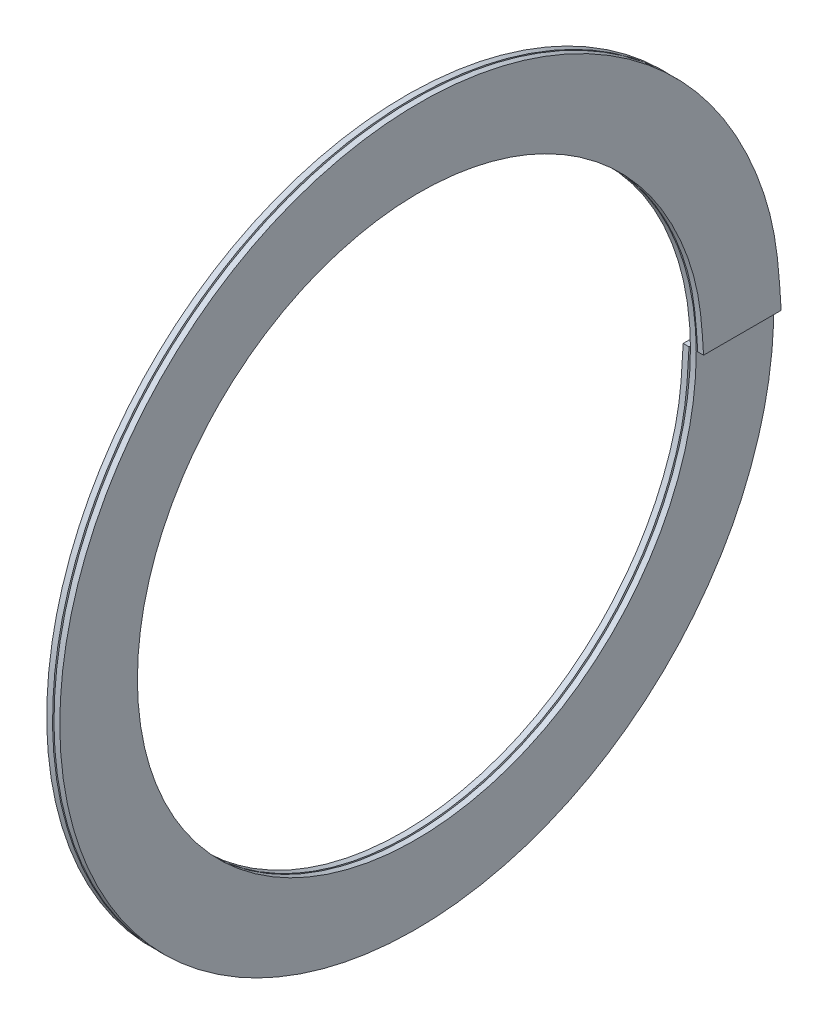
ISO-10303-21;
HEADER;
FILE_DESCRIPTION(('STEP AP214'),'2;1');
FILE_NAME('part.step','',(''),(''),'','','');
FILE_SCHEMA(('AUTOMOTIVE_DESIGN { 1 0 10303 214 1 1 1 1 }'));
ENDSEC;
DATA;
#1=APPLICATION_CONTEXT('core data for automotive mechanical design processes');
#2=APPLICATION_PROTOCOL_DEFINITION('international standard','automotive_design',2000,#1);
#3=PRODUCT_CONTEXT('',#1,'mechanical');
#4=PRODUCT('Part','Part','',(#3));
#5=PRODUCT_RELATED_PRODUCT_CATEGORY('part','',(#4));
#6=PRODUCT_DEFINITION_FORMATION('','',#4);
#7=PRODUCT_DEFINITION_CONTEXT('part definition',#1,'design');
#8=PRODUCT_DEFINITION('design','',#6,#7);
#9=PRODUCT_DEFINITION_SHAPE('','',#8);
#10=(LENGTH_UNIT() NAMED_UNIT(*) SI_UNIT(.MILLI.,.METRE.));
#11=(NAMED_UNIT(*) PLANE_ANGLE_UNIT() SI_UNIT($,.RADIAN.));
#12=(NAMED_UNIT(*) SI_UNIT($,.STERADIAN.) SOLID_ANGLE_UNIT());
#13=UNCERTAINTY_MEASURE_WITH_UNIT(LENGTH_MEASURE(1.E-05),#10,'distance_accuracy_value','');
#14=(GEOMETRIC_REPRESENTATION_CONTEXT(3) GLOBAL_UNCERTAINTY_ASSIGNED_CONTEXT((#13)) GLOBAL_UNIT_ASSIGNED_CONTEXT((#10,
#11,#12)) REPRESENTATION_CONTEXT('',''));
#15=CARTESIAN_POINT('',(0.,0.,0.));
#16=DIRECTION('',(0.,0.,1.));
#17=DIRECTION('',(1.,0.,0.));
#18=AXIS2_PLACEMENT_3D('',#15,#16,#17);
#19=CARTESIAN_POINT('',(0.450000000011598,-3.47117458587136E-13,-14.5000026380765));
#20=DIRECTION('',(-1.59174199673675E-13,0.999999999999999,3.61950505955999E-08));
#21=DIRECTION('',(-8.79358842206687E-06,-3.61950505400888E-08,0.999999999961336));
#22=AXIS2_PLACEMENT_3D('',#19,#20,#21);
#23=PLANE('',#22);
#24=DIRECTION('',(-8.79358842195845E-06,-3.61950505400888E-08,0.999999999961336));
#25=VECTOR('',#24,1.);
#26=CARTESIAN_POINT('',(0.450035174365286,1.44779855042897E-07,-18.5000026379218));
#27=LINE('',#26,#25);
#28=CARTESIAN_POINT('',(0.450035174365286,1.44779855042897E-07,-18.5000026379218));
#29=VERTEX_POINT('',#28);
#30=CARTESIAN_POINT('',(0.450000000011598,-3.47117458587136E-13,-14.5000026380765));
#31=VERTEX_POINT('',#30);
#32=EDGE_CURVE('E77',#29,#31,#27,.T.);
#33=ORIENTED_EDGE('',*,*,#32,.F.);
#34=DIRECTION('',(-0.999999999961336,1.59112295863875E-13,-8.7935884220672E-06));
#35=VECTOR('',#34,1.);
#36=CARTESIAN_POINT('',(0.450035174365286,1.44779855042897E-07,-18.5000026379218));
#37=LINE('',#36,#35);
#38=CARTESIAN_POINT('',(0.750035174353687,1.44779807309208E-07,-18.4999999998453));
#39=VERTEX_POINT('',#38);
#40=EDGE_CURVE('E35',#39,#29,#37,.T.);
#41=ORIENTED_EDGE('',*,*,#40,.F.);
#42=DIRECTION('',(8.79358842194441E-06,3.61950505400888E-08,-0.999999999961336));
#43=VECTOR('',#42,1.);
#44=CARTESIAN_POINT('',(0.750035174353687,1.44779807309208E-07,-18.4999999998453));
#45=LINE('',#44,#43);
#46=CARTESIAN_POINT('',(0.749999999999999,-3.94851147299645E-13,-14.5));
#47=VERTEX_POINT('',#46);
#48=EDGE_CURVE('E85',#47,#39,#45,.T.);
#49=ORIENTED_EDGE('',*,*,#48,.F.);
#50=DIRECTION('',(0.999999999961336,-1.59112295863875E-13,8.7935884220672E-06));
#51=VECTOR('',#50,1.);
#52=CARTESIAN_POINT('',(0.450000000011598,-3.47117458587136E-13,-14.5000026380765));
#53=LINE('',#52,#51);
#54=EDGE_CURVE('E87',#31,#47,#53,.T.);
#55=ORIENTED_EDGE('',*,*,#54,.F.);
#56=EDGE_LOOP('',(#33,#41,#49,#55));
#57=FACE_BOUND('',#56,.T.);
#58=ADVANCED_FACE('F32',(#57),#23,.F.);
#59=CARTESIAN_POINT('',(-0.299999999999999,0.,-14.5));
#60=DIRECTION('',(0.,1.,0.));
#61=DIRECTION('',(0.,0.,1.));
#62=AXIS2_PLACEMENT_3D('',#59,#60,#61);
#63=PLANE('',#62);
#64=DIRECTION('',(0.,0.,1.));
#65=VECTOR('',#64,1.);
#66=CARTESIAN_POINT('',(-0.3,0.,-18.5));
#67=LINE('',#66,#65);
#68=CARTESIAN_POINT('',(-0.3,0.,-18.5));
#69=VERTEX_POINT('',#68);
#70=CARTESIAN_POINT('',(-0.299999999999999,0.,-14.5));
#71=VERTEX_POINT('',#70);
#72=EDGE_CURVE('E79',#69,#71,#67,.T.);
#73=ORIENTED_EDGE('',*,*,#72,.T.);
#74=DIRECTION('',(1.,0.,0.));
#75=VECTOR('',#74,1.);
#76=CARTESIAN_POINT('',(-0.299999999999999,0.,-14.5));
#77=LINE('',#76,#75);
#78=CARTESIAN_POINT('',(0.,0.,-14.5));
#79=VERTEX_POINT('',#78);
#80=EDGE_CURVE('E103',#71,#79,#77,.T.);
#81=ORIENTED_EDGE('',*,*,#80,.T.);
#82=DIRECTION('',(0.,0.,-1.));
#83=VECTOR('',#82,1.);
#84=CARTESIAN_POINT('',(0.,0.,-18.5));
#85=LINE('',#84,#83);
#86=CARTESIAN_POINT('',(0.,0.,-18.5));
#87=VERTEX_POINT('',#86);
#88=EDGE_CURVE('E41',#79,#87,#85,.T.);
#89=ORIENTED_EDGE('',*,*,#88,.T.);
#90=DIRECTION('',(-1.,0.,0.));
#91=VECTOR('',#90,1.);
#92=CARTESIAN_POINT('',(-0.3,0.,-18.5));
#93=LINE('',#92,#91);
#94=EDGE_CURVE('E11',#87,#69,#93,.T.);
#95=ORIENTED_EDGE('',*,*,#94,.T.);
#96=EDGE_LOOP('',(#73,#81,#89,#95));
#97=FACE_BOUND('',#96,.T.);
#98=ADVANCED_FACE('F123',(#97),#63,.T.);
#99=CARTESIAN_POINT('',(0.,0.,-14.5));
#100=CARTESIAN_POINT('',(0.00389853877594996,-0.947060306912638,-14.4452835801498));
#101=CARTESIAN_POINT('',(0.0117083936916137,-2.84428488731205,-14.3356714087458));
#102=CARTESIAN_POINT('',(0.0234367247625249,-5.58478837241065,-13.4771657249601));
#103=CARTESIAN_POINT('',(0.0351594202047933,-8.10780533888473,-12.1350663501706));
#104=CARTESIAN_POINT('',(0.0468708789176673,-10.3187548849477,-10.319605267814));
#105=CARTESIAN_POINT('',(0.0585977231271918,-12.1331887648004,-8.10572456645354));
#106=CARTESIAN_POINT('',(0.070308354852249,-13.4827772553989,-5.58607573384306));
#107=CARTESIAN_POINT('',(0.0820363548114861,-14.3120718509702,-2.84550257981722));
#108=CARTESIAN_POINT('',(0.0937441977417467,-14.5938378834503,-0.00155721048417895));
#109=CARTESIAN_POINT('',(0.105474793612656,-14.3115210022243,2.84847466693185));
#110=CARTESIAN_POINT('',(0.117181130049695,-13.4834996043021,5.58310851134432));
#111=CARTESIAN_POINT('',(0.128912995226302,-12.1321481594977,8.10868693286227));
#112=CARTESIAN_POINT('',(0.140617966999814,-10.3205192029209,10.3177566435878));
#113=CARTESIAN_POINT('',(0.15235097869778,-8.10557337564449,12.1344708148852));
#114=CARTESIAN_POINT('',(0.164055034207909,-5.58651260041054,13.481614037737));
#115=CARTESIAN_POINT('',(0.175789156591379,-2.84479478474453,14.3128768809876));
#116=CARTESIAN_POINT('',(0.188785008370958,0.311904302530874,14.6240674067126));
#117=CARTESIAN_POINT('',(0.203129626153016,3.79731976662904,14.1672481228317));
#118=CARTESIAN_POINT('',(0.218751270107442,7.33318512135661,12.7003117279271));
#119=CARTESIAN_POINT('',(0.234372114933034,10.3695898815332,10.371008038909));
#120=CARTESIAN_POINT('',(0.24999995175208,12.7020521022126,7.33353657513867));
#121=CARTESIAN_POINT('',(0.265628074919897,14.166321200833,3.7947942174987));
#122=CARTESIAN_POINT('',(0.281248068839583,14.6655088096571,0.000683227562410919));
#123=CARTESIAN_POINT('',(0.296872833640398,14.1673924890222,-3.79547764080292));
#124=CARTESIAN_POINT('',(0.312503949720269,12.7005919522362,-7.33414525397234));
#125=CARTESIAN_POINT('',(0.328124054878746,10.3702048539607,-10.3697163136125));
#126=CARTESIAN_POINT('',(0.343746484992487,7.33430538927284,-12.7012584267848));
#127=CARTESIAN_POINT('',(0.359379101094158,3.79472788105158,-14.1670351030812));
#128=CARTESIAN_POINT('',(0.375000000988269,-2.41922414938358E-07,-14.6652811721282));
#129=CARTESIAN_POINT('',(0.390620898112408,-3.79472768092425,-14.1670351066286));
#130=CARTESIAN_POINT('',(0.406253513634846,-7.33430511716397,-12.7012586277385));
#131=CARTESIAN_POINT('',(0.42187594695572,-10.3702051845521,-10.369716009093));
#132=CARTESIAN_POINT('',(0.437496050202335,-12.7005918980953,-7.33414524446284));
#133=CARTESIAN_POINT('',(0.453127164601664,-14.1673923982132,-3.79547806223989));
#134=CARTESIAN_POINT('',(0.468751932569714,-14.6655088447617,0.000683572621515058));
#135=CARTESIAN_POINT('',(0.484371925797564,-14.1663211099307,3.79479437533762));
#136=CARTESIAN_POINT('',(0.500000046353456,-12.702052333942,7.33353617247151));
#137=CARTESIAN_POINT('',(0.515627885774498,-10.3695897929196,10.3710081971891));
#138=CARTESIAN_POINT('',(0.531248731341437,-7.33318479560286,12.7003118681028));
#139=CARTESIAN_POINT('',(0.546870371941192,-3.79732021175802,14.1672479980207));
#140=CARTESIAN_POINT('',(0.561214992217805,-0.3119041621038,14.6240674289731));
#141=CARTESIAN_POINT('',(0.574210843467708,2.84479479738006,14.3128768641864));
#142=CARTESIAN_POINT('',(0.585944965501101,5.58651253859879,13.4816140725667));
#143=CARTESIAN_POINT('',(0.597649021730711,8.1055734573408,12.1344707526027));
#144=CARTESIAN_POINT('',(0.609382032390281,10.320519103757,10.3177567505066));
#145=CARTESIAN_POINT('',(0.621087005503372,12.1321482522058,8.10868678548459));
#146=CARTESIAN_POINT('',(0.632818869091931,13.4834995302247,5.58310870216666));
#147=CARTESIAN_POINT('',(0.644525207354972,14.3115210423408,2.84847443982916));
#148=CARTESIAN_POINT('',(0.656255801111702,14.5938378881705,-0.00155693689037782));
#149=CARTESIAN_POINT('',(0.667963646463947,14.3120717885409,-2.84550287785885));
#150=CARTESIAN_POINT('',(0.679691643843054,13.4827773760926,-5.58607544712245));
#151=CARTESIAN_POINT('',(0.69140227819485,12.1331885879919,-8.10572482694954));
#152=CARTESIAN_POINT('',(0.703129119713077,10.3187551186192,-10.3196050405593));
#153=CARTESIAN_POINT('',(0.71484058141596,8.10780501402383,-12.1350665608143));
#154=CARTESIAN_POINT('',(0.726563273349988,5.58478879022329,-13.4771655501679));
#155=CARTESIAN_POINT('',(0.738291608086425,2.84428447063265,-14.3356715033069));
#156=CARTESIAN_POINT('',(0.746101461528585,0.947060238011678,-14.4452836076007));
#157=CARTESIAN_POINT('',(0.749999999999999,-3.94851147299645E-13,-14.5));
#158=CARTESIAN_POINT('',(-0.299999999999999,0.,-14.5));
#159=CARTESIAN_POINT('',(-0.296101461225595,-0.947060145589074,-14.4452832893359));
#160=CARTESIAN_POINT('',(-0.288291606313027,-2.84428440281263,-14.3356705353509));
#161=CARTESIAN_POINT('',(-0.276563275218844,-5.58479029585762,-13.4771691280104));
#162=CARTESIAN_POINT('',(-0.264840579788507,-8.10780616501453,-12.1350681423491));
#163=CARTESIAN_POINT('',(-0.253129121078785,-10.3187563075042,-10.3196061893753));
#164=CARTESIAN_POINT('',(-0.241402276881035,-12.1331870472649,-8.10572383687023));
#165=CARTESIAN_POINT('',(-0.229691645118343,-13.4827824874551,-5.58607746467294));
#166=CARTESIAN_POINT('',(-0.217963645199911,-14.3120703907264,-2.84550253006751));
#167=CARTESIAN_POINT('',(-0.206255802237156,-14.5938425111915,-0.00155692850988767));
#168=CARTESIAN_POINT('',(-0.194525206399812,-14.3115187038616,2.84847400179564));
#169=CARTESIAN_POINT('',(-0.18281886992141,-13.4835048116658,5.58311093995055));
#170=CARTESIAN_POINT('',(-0.171087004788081,-12.1321459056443,8.10868526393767));
#171=CARTESIAN_POINT('',(-0.159382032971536,-10.3205232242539,10.3177609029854));
#172=CARTESIAN_POINT('',(-0.147649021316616,-8.10557167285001,12.1344681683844));
#173=CARTESIAN_POINT('',(-0.135944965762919,-5.58651484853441,13.4816196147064));
#174=CARTESIAN_POINT('',(-0.124210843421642,-2.84479406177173,14.3128739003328));
#175=CARTESIAN_POINT('',(-0.111214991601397,0.311903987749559,14.6240731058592));
#176=CARTESIAN_POINT('',(-0.0968703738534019,3.79732039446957,14.1672471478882));
#177=CARTESIAN_POINT('',(-0.0812487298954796,7.33318448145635,12.7003116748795));
#178=CARTESIAN_POINT('',(-0.0656278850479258,10.3695925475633,10.3710109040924));
#179=CARTESIAN_POINT('',(-0.0500000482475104,12.7020535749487,7.33353669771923));
#180=CARTESIAN_POINT('',(-0.0343719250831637,14.16631993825,3.79479405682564));
#181=CARTESIAN_POINT('',(-0.0187519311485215,14.6655119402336,0.000683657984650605));
#182=CARTESIAN_POINT('',(-0.00312716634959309,14.1673952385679,-3.79547900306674));
#183=CARTESIAN_POINT('',(0.0125039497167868,12.7005903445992,-7.33414443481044));
#184=CARTESIAN_POINT('',(0.0281240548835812,10.3702068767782,-10.3697174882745));
#185=CARTESIAN_POINT('',(0.0437464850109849,7.33430698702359,-12.7012621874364));
#186=CARTESIAN_POINT('',(0.0593791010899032,3.79472708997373,-14.1670333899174));
#187=CARTESIAN_POINT('',(0.0750000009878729,4.1471686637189E-07,-14.6652825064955));
#188=CARTESIAN_POINT('',(0.0906208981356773,-3.79472916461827,-14.1670393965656));
#189=CARTESIAN_POINT('',(0.106253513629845,-7.33430485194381,-12.7012571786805));
#190=CARTESIAN_POINT('',(0.121875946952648,-10.3702050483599,-10.3697167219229));
#191=CARTESIAN_POINT('',(0.13749605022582,-12.7005958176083,-7.33414739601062));
#192=CARTESIAN_POINT('',(0.153127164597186,-14.167392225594,-3.79547739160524));
#193=CARTESIAN_POINT('',(0.168751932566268,-14.6655083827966,0.000683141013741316));
#194=CARTESIAN_POINT('',(0.18437192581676,-14.1663249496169,3.79479522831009));
#195=CARTESIAN_POINT('',(0.200000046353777,-12.7020531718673,7.33353738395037));
#196=CARTESIAN_POINT('',(0.215627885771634,-10.3695890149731,10.3710072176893));
#197=CARTESIAN_POINT('',(0.231248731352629,-7.3331867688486,12.7003142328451));
#198=CARTESIAN_POINT('',(0.246870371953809,-3.79732027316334,14.1672515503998));
#199=CARTESIAN_POINT('',(0.26121499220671,-0.311904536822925,14.6240643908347));
#200=CARTESIAN_POINT('',(0.274210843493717,2.8447960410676,14.3128824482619));
#201=CARTESIAN_POINT('',(0.285944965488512,5.58651130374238,13.481610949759));
#202=CARTESIAN_POINT('',(0.297649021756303,8.10557663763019,12.134475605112));
#203=CARTESIAN_POINT('',(0.30938203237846,10.320516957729,10.3177543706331));
#204=CARTESIAN_POINT('',(0.321087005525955,12.1321527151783,8.10868992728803));
#205=CARTESIAN_POINT('',(0.332818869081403,13.4834967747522,5.58310729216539));
#206=CARTESIAN_POINT('',(0.344525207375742,14.3115259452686,2.84847562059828));
#207=CARTESIAN_POINT('',(0.356255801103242,14.5938359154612,-0.0015572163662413));
#208=CARTESIAN_POINT('',(0.367963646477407,14.3120758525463,-2.84550344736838));
#209=CARTESIAN_POINT('',(0.37969164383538,13.4827745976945,-5.58607473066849));
#210=CARTESIAN_POINT('',(0.391402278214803,12.1331925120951,-8.10572703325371));
#211=CARTESIAN_POINT('',(0.403129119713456,10.3187555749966,-10.3196059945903));
#212=CARTESIAN_POINT('',(0.41484058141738,8.1078056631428,-12.1350669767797));
#213=CARTESIAN_POINT('',(0.426563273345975,5.58478788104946,-13.4771645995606));
#214=CARTESIAN_POINT('',(0.438291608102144,2.84428547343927,-14.3356749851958));
#215=CARTESIAN_POINT('',(0.446101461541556,0.947060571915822,-14.4452865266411));
#216=CARTESIAN_POINT('',(0.450000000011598,-3.47117458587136E-13,-14.5000026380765));
#217=B_SPLINE_SURFACE_WITH_KNOTS('',1,3,((#99,#100,#101,#102,#103,#104,#105,#106,#107,#108,#109,
#110,#111,#112,#113,#114,#115,#116,#117,#118,#119,#120,#121,#122,#123,#124,#125,#126,#127,#128,
#129,#130,#131,#132,#133,#134,#135,#136,#137,#138,#139,#140,#141,#142,#143,#144,#145,#146,#147,
#148,#149,#150,#151,#152,#153,#154,#155,#156,#157),(#158,#159,#160,#161,#162,#163,#164,#165,
#166,#167,#168,#169,#170,#171,#172,#173,#174,#175,#176,#177,#178,#179,#180,#181,#182,#183,#184,
#185,#186,#187,#188,#189,#190,#191,#192,#193,#194,#195,#196,#197,#198,#199,#200,#201,#202,#203,
#204,#205,#206,#207,#208,#209,#210,#211,#212,#213,#214,#215,#216)),.UNSPECIFIED.,.F.,.F.,.F.,(2,
2),(4,1,1,1,1,1,1,1,1,1,1,1,1,1,1,1,1,1,1,1,1,1,1,1,1,1,1,1,1,1,1,1,1,1,1,1,1,1,1,1,1,1,1,1,1,1,
1,1,1,1,1,1,1,1,1,1,4),(0.965116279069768,1.),(0.,0.0156076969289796,0.031266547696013,
0.0469101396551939,0.0625421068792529,0.0781707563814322,0.0938100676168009,0.10944182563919,
0.125080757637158,0.14071059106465,0.156350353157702,0.171979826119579,0.187620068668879,
0.203249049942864,0.218889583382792,0.234518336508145,0.250159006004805,0.270974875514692,
0.291795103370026,0.312619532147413,0.333437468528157,0.354255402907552,0.375079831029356,
0.395900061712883,0.416715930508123,0.437539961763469,0.458361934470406,0.479176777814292,
0.500000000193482,0.52082322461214,0.541638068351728,0.562460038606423,0.58328407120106,
0.604099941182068,0.624920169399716,0.645744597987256,0.666562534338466,0.687380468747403,
0.708204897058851,0.729025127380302,0.749840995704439,0.765481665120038,0.781110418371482,
0.79675095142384,0.812379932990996,0.828020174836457,0.843649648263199,0.859289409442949,
0.874919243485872,0.890558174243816,0.906189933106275,0.921829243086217,0.937457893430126,
0.953089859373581,0.968733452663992,0.984392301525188,1.),.UNSPECIFIED.);
#218=CARTESIAN_POINT('',(-0.299999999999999,0.,-14.5));
#219=CARTESIAN_POINT('',(-0.296101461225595,-0.947060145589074,-14.4452832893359));
#220=CARTESIAN_POINT('',(-0.288291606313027,-2.84428440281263,-14.3356705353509));
#221=CARTESIAN_POINT('',(-0.276563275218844,-5.58479029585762,-13.4771691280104));
#222=CARTESIAN_POINT('',(-0.264840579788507,-8.10780616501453,-12.1350681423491));
#223=CARTESIAN_POINT('',(-0.253129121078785,-10.3187563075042,-10.3196061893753));
#224=CARTESIAN_POINT('',(-0.241402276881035,-12.1331870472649,-8.10572383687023));
#225=CARTESIAN_POINT('',(-0.229691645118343,-13.4827824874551,-5.58607746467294));
#226=CARTESIAN_POINT('',(-0.217963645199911,-14.3120703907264,-2.84550253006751));
#227=CARTESIAN_POINT('',(-0.206255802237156,-14.5938425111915,-0.00155692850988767));
#228=CARTESIAN_POINT('',(-0.194525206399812,-14.3115187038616,2.84847400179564));
#229=CARTESIAN_POINT('',(-0.18281886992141,-13.4835048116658,5.58311093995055));
#230=CARTESIAN_POINT('',(-0.171087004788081,-12.1321459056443,8.10868526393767));
#231=CARTESIAN_POINT('',(-0.159382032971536,-10.3205232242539,10.3177609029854));
#232=CARTESIAN_POINT('',(-0.147649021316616,-8.10557167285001,12.1344681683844));
#233=CARTESIAN_POINT('',(-0.135944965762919,-5.58651484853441,13.4816196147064));
#234=CARTESIAN_POINT('',(-0.124210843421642,-2.84479406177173,14.3128739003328));
#235=CARTESIAN_POINT('',(-0.111214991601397,0.311903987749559,14.6240731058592));
#236=CARTESIAN_POINT('',(-0.0968703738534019,3.79732039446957,14.1672471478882));
#237=CARTESIAN_POINT('',(-0.0812487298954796,7.33318448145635,12.7003116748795));
#238=CARTESIAN_POINT('',(-0.0656278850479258,10.3695925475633,10.3710109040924));
#239=CARTESIAN_POINT('',(-0.0500000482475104,12.7020535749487,7.33353669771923));
#240=CARTESIAN_POINT('',(-0.0343719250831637,14.16631993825,3.79479405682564));
#241=CARTESIAN_POINT('',(-0.0187519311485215,14.6655119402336,0.000683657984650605));
#242=CARTESIAN_POINT('',(-0.00312716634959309,14.1673952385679,-3.79547900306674));
#243=CARTESIAN_POINT('',(0.0125039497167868,12.7005903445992,-7.33414443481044));
#244=CARTESIAN_POINT('',(0.0281240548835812,10.3702068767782,-10.3697174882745));
#245=CARTESIAN_POINT('',(0.0437464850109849,7.33430698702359,-12.7012621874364));
#246=CARTESIAN_POINT('',(0.0593791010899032,3.79472708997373,-14.1670333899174));
#247=CARTESIAN_POINT('',(0.0750000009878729,4.1471686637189E-07,-14.6652825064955));
#248=CARTESIAN_POINT('',(0.0906208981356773,-3.79472916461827,-14.1670393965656));
#249=CARTESIAN_POINT('',(0.106253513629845,-7.33430485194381,-12.7012571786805));
#250=CARTESIAN_POINT('',(0.121875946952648,-10.3702050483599,-10.3697167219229));
#251=CARTESIAN_POINT('',(0.13749605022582,-12.7005958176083,-7.33414739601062));
#252=CARTESIAN_POINT('',(0.153127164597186,-14.167392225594,-3.79547739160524));
#253=CARTESIAN_POINT('',(0.168751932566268,-14.6655083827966,0.000683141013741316));
#254=CARTESIAN_POINT('',(0.18437192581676,-14.1663249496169,3.79479522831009));
#255=CARTESIAN_POINT('',(0.200000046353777,-12.7020531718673,7.33353738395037));
#256=CARTESIAN_POINT('',(0.215627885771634,-10.3695890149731,10.3710072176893));
#257=CARTESIAN_POINT('',(0.231248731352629,-7.3331867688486,12.7003142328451));
#258=CARTESIAN_POINT('',(0.246870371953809,-3.79732027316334,14.1672515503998));
#259=CARTESIAN_POINT('',(0.26121499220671,-0.311904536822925,14.6240643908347));
#260=CARTESIAN_POINT('',(0.274210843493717,2.8447960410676,14.3128824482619));
#261=CARTESIAN_POINT('',(0.285944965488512,5.58651130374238,13.481610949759));
#262=CARTESIAN_POINT('',(0.297649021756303,8.10557663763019,12.134475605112));
#263=CARTESIAN_POINT('',(0.30938203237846,10.320516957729,10.3177543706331));
#264=CARTESIAN_POINT('',(0.321087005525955,12.1321527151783,8.10868992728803));
#265=CARTESIAN_POINT('',(0.332818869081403,13.4834967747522,5.58310729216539));
#266=CARTESIAN_POINT('',(0.344525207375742,14.3115259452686,2.84847562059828));
#267=CARTESIAN_POINT('',(0.356255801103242,14.5938359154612,-0.0015572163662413));
#268=CARTESIAN_POINT('',(0.367963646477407,14.3120758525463,-2.84550344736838));
#269=CARTESIAN_POINT('',(0.37969164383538,13.4827745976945,-5.58607473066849));
#270=CARTESIAN_POINT('',(0.391402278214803,12.1331925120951,-8.10572703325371));
#271=CARTESIAN_POINT('',(0.403129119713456,10.3187555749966,-10.3196059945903));
#272=CARTESIAN_POINT('',(0.41484058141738,8.1078056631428,-12.1350669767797));
#273=CARTESIAN_POINT('',(0.426563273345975,5.58478788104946,-13.4771645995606));
#274=CARTESIAN_POINT('',(0.438291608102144,2.84428547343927,-14.3356749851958));
#275=CARTESIAN_POINT('',(0.446101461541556,0.947060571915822,-14.4452865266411));
#276=CARTESIAN_POINT('',(0.450000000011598,-3.47117458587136E-13,-14.5000026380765));
#277=B_SPLINE_CURVE_WITH_KNOTS('',3,(#218,#219,#220,#221,#222,#223,#224,#225,#226,#227,#228,
#229,#230,#231,#232,#233,#234,#235,#236,#237,#238,#239,#240,#241,#242,#243,#244,#245,#246,#247,
#248,#249,#250,#251,#252,#253,#254,#255,#256,#257,#258,#259,#260,#261,#262,#263,#264,#265,#266,
#267,#268,#269,#270,#271,#272,#273,#274,#275,#276),.UNSPECIFIED.,.F.,.F.,(4,1,1,1,1,1,1,1,1,1,1,
1,1,1,1,1,1,1,1,1,1,1,1,1,1,1,1,1,1,1,1,1,1,1,1,1,1,1,1,1,1,1,1,1,1,1,1,1,1,1,1,1,1,1,1,1,4),
(0.,0.0156076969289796,0.031266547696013,0.0469101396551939,0.0625421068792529,
0.0781707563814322,0.0938100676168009,0.10944182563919,0.125080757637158,0.14071059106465,
0.156350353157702,0.171979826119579,0.187620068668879,0.203249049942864,0.218889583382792,
0.234518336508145,0.250159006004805,0.270974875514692,0.291795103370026,0.312619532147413,
0.333437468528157,0.354255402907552,0.375079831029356,0.395900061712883,0.416715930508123,
0.437539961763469,0.458361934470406,0.479176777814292,0.500000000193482,0.52082322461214,
0.541638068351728,0.562460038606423,0.58328407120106,0.604099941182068,0.624920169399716,
0.645744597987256,0.666562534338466,0.687380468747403,0.708204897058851,0.729025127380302,
0.749840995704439,0.765481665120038,0.781110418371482,0.79675095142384,0.812379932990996,
0.828020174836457,0.843649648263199,0.859289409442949,0.874919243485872,0.890558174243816,
0.906189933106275,0.921829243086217,0.937457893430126,0.953089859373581,0.968733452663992,
0.984392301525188,1.),.UNSPECIFIED.);
#278=EDGE_CURVE('E102',#71,#31,#277,.T.);
#279=CARTESIAN_POINT('',(0.,0.,-14.5));
#280=CARTESIAN_POINT('',(0.00389853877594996,-0.947060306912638,-14.4452835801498));
#281=CARTESIAN_POINT('',(0.0117083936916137,-2.84428488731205,-14.3356714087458));
#282=CARTESIAN_POINT('',(0.0234367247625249,-5.58478837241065,-13.4771657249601));
#283=CARTESIAN_POINT('',(0.0351594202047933,-8.10780533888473,-12.1350663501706));
#284=CARTESIAN_POINT('',(0.0468708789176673,-10.3187548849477,-10.319605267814));
#285=CARTESIAN_POINT('',(0.0585977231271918,-12.1331887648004,-8.10572456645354));
#286=CARTESIAN_POINT('',(0.070308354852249,-13.4827772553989,-5.58607573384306));
#287=CARTESIAN_POINT('',(0.0820363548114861,-14.3120718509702,-2.84550257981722));
#288=CARTESIAN_POINT('',(0.0937441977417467,-14.5938378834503,-0.00155721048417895));
#289=CARTESIAN_POINT('',(0.105474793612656,-14.3115210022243,2.84847466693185));
#290=CARTESIAN_POINT('',(0.117181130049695,-13.4834996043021,5.58310851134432));
#291=CARTESIAN_POINT('',(0.128912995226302,-12.1321481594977,8.10868693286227));
#292=CARTESIAN_POINT('',(0.140617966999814,-10.3205192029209,10.3177566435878));
#293=CARTESIAN_POINT('',(0.15235097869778,-8.10557337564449,12.1344708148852));
#294=CARTESIAN_POINT('',(0.164055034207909,-5.58651260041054,13.481614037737));
#295=CARTESIAN_POINT('',(0.175789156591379,-2.84479478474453,14.3128768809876));
#296=CARTESIAN_POINT('',(0.188785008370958,0.311904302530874,14.6240674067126));
#297=CARTESIAN_POINT('',(0.203129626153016,3.79731976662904,14.1672481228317));
#298=CARTESIAN_POINT('',(0.218751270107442,7.33318512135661,12.7003117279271));
#299=CARTESIAN_POINT('',(0.234372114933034,10.3695898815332,10.371008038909));
#300=CARTESIAN_POINT('',(0.24999995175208,12.7020521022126,7.33353657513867));
#301=CARTESIAN_POINT('',(0.265628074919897,14.166321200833,3.7947942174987));
#302=CARTESIAN_POINT('',(0.281248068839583,14.6655088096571,0.000683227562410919));
#303=CARTESIAN_POINT('',(0.296872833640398,14.1673924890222,-3.79547764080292));
#304=CARTESIAN_POINT('',(0.312503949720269,12.7005919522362,-7.33414525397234));
#305=CARTESIAN_POINT('',(0.328124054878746,10.3702048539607,-10.3697163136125));
#306=CARTESIAN_POINT('',(0.343746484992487,7.33430538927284,-12.7012584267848));
#307=CARTESIAN_POINT('',(0.359379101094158,3.79472788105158,-14.1670351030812));
#308=CARTESIAN_POINT('',(0.375000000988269,-2.41922414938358E-07,-14.6652811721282));
#309=CARTESIAN_POINT('',(0.390620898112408,-3.79472768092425,-14.1670351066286));
#310=CARTESIAN_POINT('',(0.406253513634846,-7.33430511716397,-12.7012586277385));
#311=CARTESIAN_POINT('',(0.42187594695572,-10.3702051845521,-10.369716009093));
#312=CARTESIAN_POINT('',(0.437496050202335,-12.7005918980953,-7.33414524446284));
#313=CARTESIAN_POINT('',(0.453127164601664,-14.1673923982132,-3.79547806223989));
#314=CARTESIAN_POINT('',(0.468751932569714,-14.6655088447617,0.000683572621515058));
#315=CARTESIAN_POINT('',(0.484371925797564,-14.1663211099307,3.79479437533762));
#316=CARTESIAN_POINT('',(0.500000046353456,-12.702052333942,7.33353617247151));
#317=CARTESIAN_POINT('',(0.515627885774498,-10.3695897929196,10.3710081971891));
#318=CARTESIAN_POINT('',(0.531248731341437,-7.33318479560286,12.7003118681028));
#319=CARTESIAN_POINT('',(0.546870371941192,-3.79732021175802,14.1672479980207));
#320=CARTESIAN_POINT('',(0.561214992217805,-0.3119041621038,14.6240674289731));
#321=CARTESIAN_POINT('',(0.574210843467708,2.84479479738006,14.3128768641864));
#322=CARTESIAN_POINT('',(0.585944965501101,5.58651253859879,13.4816140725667));
#323=CARTESIAN_POINT('',(0.597649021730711,8.1055734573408,12.1344707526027));
#324=CARTESIAN_POINT('',(0.609382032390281,10.320519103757,10.3177567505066));
#325=CARTESIAN_POINT('',(0.621087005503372,12.1321482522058,8.10868678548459));
#326=CARTESIAN_POINT('',(0.632818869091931,13.4834995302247,5.58310870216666));
#327=CARTESIAN_POINT('',(0.644525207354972,14.3115210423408,2.84847443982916));
#328=CARTESIAN_POINT('',(0.656255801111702,14.5938378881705,-0.00155693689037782));
#329=CARTESIAN_POINT('',(0.667963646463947,14.3120717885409,-2.84550287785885));
#330=CARTESIAN_POINT('',(0.679691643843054,13.4827773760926,-5.58607544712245));
#331=CARTESIAN_POINT('',(0.69140227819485,12.1331885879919,-8.10572482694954));
#332=CARTESIAN_POINT('',(0.703129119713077,10.3187551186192,-10.3196050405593));
#333=CARTESIAN_POINT('',(0.71484058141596,8.10780501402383,-12.1350665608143));
#334=CARTESIAN_POINT('',(0.726563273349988,5.58478879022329,-13.4771655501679));
#335=CARTESIAN_POINT('',(0.738291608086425,2.84428447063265,-14.3356715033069));
#336=CARTESIAN_POINT('',(0.746101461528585,0.947060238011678,-14.4452836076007));
#337=CARTESIAN_POINT('',(0.749999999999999,-3.94851147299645E-13,-14.5));
#338=B_SPLINE_CURVE_WITH_KNOTS('',3,(#279,#280,#281,#282,#283,#284,#285,#286,#287,#288,#289,
#290,#291,#292,#293,#294,#295,#296,#297,#298,#299,#300,#301,#302,#303,#304,#305,#306,#307,#308,
#309,#310,#311,#312,#313,#314,#315,#316,#317,#318,#319,#320,#321,#322,#323,#324,#325,#326,#327,
#328,#329,#330,#331,#332,#333,#334,#335,#336,#337),.UNSPECIFIED.,.F.,.F.,(4,1,1,1,1,1,1,1,1,1,1,
1,1,1,1,1,1,1,1,1,1,1,1,1,1,1,1,1,1,1,1,1,1,1,1,1,1,1,1,1,1,1,1,1,1,1,1,1,1,1,1,1,1,1,1,1,4),
(0.,0.0156076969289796,0.031266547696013,0.0469101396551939,0.0625421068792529,
0.0781707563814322,0.0938100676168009,0.10944182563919,0.125080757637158,0.14071059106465,
0.156350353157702,0.171979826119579,0.187620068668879,0.203249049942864,0.218889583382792,
0.234518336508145,0.250159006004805,0.270974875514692,0.291795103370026,0.312619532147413,
0.333437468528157,0.354255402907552,0.375079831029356,0.395900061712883,0.416715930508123,
0.437539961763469,0.458361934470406,0.479176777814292,0.500000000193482,0.52082322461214,
0.541638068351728,0.562460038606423,0.58328407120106,0.604099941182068,0.624920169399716,
0.645744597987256,0.666562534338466,0.687380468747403,0.708204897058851,0.729025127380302,
0.749840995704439,0.765481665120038,0.781110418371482,0.79675095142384,0.812379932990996,
0.828020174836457,0.843649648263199,0.859289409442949,0.874919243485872,0.890558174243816,
0.906189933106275,0.921829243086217,0.937457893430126,0.953089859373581,0.968733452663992,
0.984392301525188,1.),.UNSPECIFIED.);
#339=EDGE_CURVE('E91',#79,#47,#338,.T.);
#340=ORIENTED_EDGE('',*,*,#80,.F.);
#341=ORIENTED_EDGE('',*,*,#278,.T.);
#342=ORIENTED_EDGE('',*,*,#54,.T.);
#343=ORIENTED_EDGE('',*,*,#339,.F.);
#344=EDGE_LOOP('',(#340,#341,#342,#343));
#345=FACE_BOUND('',#344,.T.);
#346=ADVANCED_FACE('F100',(#345),#217,.T.);
#347=CARTESIAN_POINT('',(0.,0.,-18.5));
#348=CARTESIAN_POINT('',(0.003894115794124,-1.20873656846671,-18.4303482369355));
#349=CARTESIAN_POINT('',(0.0116951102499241,-3.63017130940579,-18.2908164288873));
#350=CARTESIAN_POINT('',(0.0234886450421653,-7.12268630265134,-17.1956979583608));
#351=CARTESIAN_POINT('',(0.0351850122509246,-10.3446605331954,-15.4831782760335));
#352=CARTESIAN_POINT('',(0.0468932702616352,-13.1676999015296,-13.1634838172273));
#353=CARTESIAN_POINT('',(0.0585725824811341,-15.4789105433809,-10.3448117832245));
#354=CARTESIAN_POINT('',(0.070382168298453,-17.2031516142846,-7.12412970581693));
#355=CARTESIAN_POINT('',(0.0820162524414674,-18.2600416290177,-3.63359172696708));
#356=CARTESIAN_POINT('',(0.0938066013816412,-18.619546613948,0.00223090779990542));
#357=CARTESIAN_POINT('',(0.105441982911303,-18.2607092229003,3.6303062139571));
#358=CARTESIAN_POINT('',(0.117258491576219,-17.2011950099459,7.12757451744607));
#359=CARTESIAN_POINT('',(0.128874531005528,-15.4817388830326,10.3419485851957));
#360=CARTESIAN_POINT('',(0.140696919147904,-13.1639622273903,13.1675964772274));
#361=CARTESIAN_POINT('',(0.152307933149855,-10.345834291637,15.4793449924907));
#362=CARTESIAN_POINT('',(0.164135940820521,-7.12288578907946,17.2027519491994));
#363=CARTESIAN_POINT('',(0.17574756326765,-3.63433181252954,18.2603296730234));
#364=CARTESIAN_POINT('',(0.188861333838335,0.402785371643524,18.6588375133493));
#365=CARTESIAN_POINT('',(0.203118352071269,4.84239294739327,18.0753005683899));
#366=CARTESIAN_POINT('',(0.218747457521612,9.35487836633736,16.2054330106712));
#367=CARTESIAN_POINT('',(0.234422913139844,13.2324082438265,13.2301875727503));
#368=CARTESIAN_POINT('',(0.25001767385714,16.205606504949,9.356312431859));
#369=CARTESIAN_POINT('',(0.265611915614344,18.0738700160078,4.84449755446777));
#370=CARTESIAN_POINT('',(0.281288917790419,18.7118072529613,-0.00111435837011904));
#371=CARTESIAN_POINT('',(0.296912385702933,18.0746731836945,-4.84416444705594));
#372=CARTESIAN_POINT('',(0.312480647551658,16.2059883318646,-9.35438358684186));
#373=CARTESIAN_POINT('',(0.328153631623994,13.2308119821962,-13.2316374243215));
#374=CARTESIAN_POINT('',(0.343799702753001,9.35476324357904,-16.2062262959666));
#375=CARTESIAN_POINT('',(0.359354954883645,4.84491148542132,-18.0740833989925));
#376=CARTESIAN_POINT('',(0.375017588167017,-2.35618202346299E-07,-18.7117663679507));
#377=CARTESIAN_POINT('',(0.390680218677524,-4.84491108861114,-18.0740834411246));
#378=CARTESIAN_POINT('',(0.406235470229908,-9.35476276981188,-16.2062266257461));
#379=CARTESIAN_POINT('',(0.421881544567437,-13.2308123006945,-13.2316371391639));
#380=CARTESIAN_POINT('',(0.437554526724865,-16.2059881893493,-9.35438370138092));
#381=CARTESIAN_POINT('',(0.453122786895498,-18.074673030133,-4.84416512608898));
#382=CARTESIAN_POINT('',(0.468746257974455,-18.7118072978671,-0.00111406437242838));
#383=CARTESIAN_POINT('',(0.48442325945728,-18.0738699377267,4.84449761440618));
#384=CARTESIAN_POINT('',(0.500017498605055,-16.2056068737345,9.356311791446));
#385=CARTESIAN_POINT('',(0.515612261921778,-13.232408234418,13.230187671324));
#386=CARTESIAN_POINT('',(0.531287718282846,-9.35487807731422,16.2054331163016));
#387=CARTESIAN_POINT('',(0.546916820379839,-4.84239365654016,18.075300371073));
#388=CARTESIAN_POINT('',(0.561173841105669,-0.402785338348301,18.6588375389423));
#389=CARTESIAN_POINT('',(0.574287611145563,3.63433168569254,18.2603296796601));
#390=CARTESIAN_POINT('',(0.585899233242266,7.12288557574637,17.2027520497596));
#391=CARTESIAN_POINT('',(0.597727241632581,10.3458342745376,15.4793449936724));
#392=CARTESIAN_POINT('',(0.609338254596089,13.163961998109,13.1675967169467));
#393=CARTESIAN_POINT('',(0.621160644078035,15.4817389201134,10.3419485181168));
#394=CARTESIAN_POINT('',(0.63277668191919,17.2011948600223,7.12757489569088));
#395=CARTESIAN_POINT('',(0.644593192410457,18.2607092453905,3.630306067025));
#396=CARTESIAN_POINT('',(0.656228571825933,18.6195466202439,0.00223140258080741));
#397=CARTESIAN_POINT('',(0.66801892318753,18.2600415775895,-3.63359196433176));
#398=CARTESIAN_POINT('',(0.679653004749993,17.2031518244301,-7.12412920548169));
#399=CARTESIAN_POINT('',(0.691462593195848,15.4789103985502,-10.3448119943));
#400=CARTESIAN_POINT('',(0.703141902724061,13.1677003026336,-13.163483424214));
#401=CARTESIAN_POINT('',(0.714850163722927,10.3446602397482,-15.4831784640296));
#402=CARTESIAN_POINT('',(0.726546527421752,7.12268697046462,-17.1956976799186));
#403=CARTESIAN_POINT('',(0.738340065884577,3.63017092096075,-18.2908165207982));
#404=CARTESIAN_POINT('',(0.746141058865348,1.20873662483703,-18.4303482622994));
#405=CARTESIAN_POINT('',(0.750035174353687,1.44779807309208E-07,-18.4999999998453));
#406=CARTESIAN_POINT('',(0.,0.,-14.5));
#407=CARTESIAN_POINT('',(0.00389853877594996,-0.947060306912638,-14.4452835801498));
#408=CARTESIAN_POINT('',(0.0117083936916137,-2.84428488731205,-14.3356714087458));
#409=CARTESIAN_POINT('',(0.0234367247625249,-5.58478837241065,-13.4771657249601));
#410=CARTESIAN_POINT('',(0.0351594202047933,-8.10780533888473,-12.1350663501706));
#411=CARTESIAN_POINT('',(0.0468708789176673,-10.3187548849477,-10.319605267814));
#412=CARTESIAN_POINT('',(0.0585977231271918,-12.1331887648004,-8.10572456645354));
#413=CARTESIAN_POINT('',(0.070308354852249,-13.4827772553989,-5.58607573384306));
#414=CARTESIAN_POINT('',(0.0820363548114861,-14.3120718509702,-2.84550257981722));
#415=CARTESIAN_POINT('',(0.0937441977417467,-14.5938378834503,-0.00155721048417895));
#416=CARTESIAN_POINT('',(0.105474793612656,-14.3115210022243,2.84847466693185));
#417=CARTESIAN_POINT('',(0.117181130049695,-13.4834996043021,5.58310851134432));
#418=CARTESIAN_POINT('',(0.128912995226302,-12.1321481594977,8.10868693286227));
#419=CARTESIAN_POINT('',(0.140617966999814,-10.3205192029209,10.3177566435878));
#420=CARTESIAN_POINT('',(0.15235097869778,-8.10557337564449,12.1344708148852));
#421=CARTESIAN_POINT('',(0.164055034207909,-5.58651260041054,13.481614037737));
#422=CARTESIAN_POINT('',(0.175789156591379,-2.84479478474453,14.3128768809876));
#423=CARTESIAN_POINT('',(0.188785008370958,0.311904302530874,14.6240674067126));
#424=CARTESIAN_POINT('',(0.203129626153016,3.79731976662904,14.1672481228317));
#425=CARTESIAN_POINT('',(0.218751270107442,7.33318512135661,12.7003117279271));
#426=CARTESIAN_POINT('',(0.234372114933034,10.3695898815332,10.371008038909));
#427=CARTESIAN_POINT('',(0.24999995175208,12.7020521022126,7.33353657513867));
#428=CARTESIAN_POINT('',(0.265628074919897,14.166321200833,3.7947942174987));
#429=CARTESIAN_POINT('',(0.281248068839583,14.6655088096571,0.000683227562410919));
#430=CARTESIAN_POINT('',(0.296872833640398,14.1673924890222,-3.79547764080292));
#431=CARTESIAN_POINT('',(0.312503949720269,12.7005919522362,-7.33414525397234));
#432=CARTESIAN_POINT('',(0.328124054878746,10.3702048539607,-10.3697163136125));
#433=CARTESIAN_POINT('',(0.343746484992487,7.33430538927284,-12.7012584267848));
#434=CARTESIAN_POINT('',(0.359379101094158,3.79472788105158,-14.1670351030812));
#435=CARTESIAN_POINT('',(0.375000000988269,-2.41922414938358E-07,-14.6652811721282));
#436=CARTESIAN_POINT('',(0.390620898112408,-3.79472768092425,-14.1670351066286));
#437=CARTESIAN_POINT('',(0.406253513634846,-7.33430511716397,-12.7012586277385));
#438=CARTESIAN_POINT('',(0.42187594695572,-10.3702051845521,-10.369716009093));
#439=CARTESIAN_POINT('',(0.437496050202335,-12.7005918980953,-7.33414524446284));
#440=CARTESIAN_POINT('',(0.453127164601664,-14.1673923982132,-3.79547806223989));
#441=CARTESIAN_POINT('',(0.468751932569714,-14.6655088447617,0.000683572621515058));
#442=CARTESIAN_POINT('',(0.484371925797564,-14.1663211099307,3.79479437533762));
#443=CARTESIAN_POINT('',(0.500000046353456,-12.702052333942,7.33353617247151));
#444=CARTESIAN_POINT('',(0.515627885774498,-10.3695897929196,10.3710081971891));
#445=CARTESIAN_POINT('',(0.531248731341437,-7.33318479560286,12.7003118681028));
#446=CARTESIAN_POINT('',(0.546870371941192,-3.79732021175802,14.1672479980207));
#447=CARTESIAN_POINT('',(0.561214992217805,-0.3119041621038,14.6240674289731));
#448=CARTESIAN_POINT('',(0.574210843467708,2.84479479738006,14.3128768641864));
#449=CARTESIAN_POINT('',(0.585944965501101,5.58651253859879,13.4816140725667));
#450=CARTESIAN_POINT('',(0.597649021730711,8.1055734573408,12.1344707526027));
#451=CARTESIAN_POINT('',(0.609382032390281,10.320519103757,10.3177567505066));
#452=CARTESIAN_POINT('',(0.621087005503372,12.1321482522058,8.10868678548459));
#453=CARTESIAN_POINT('',(0.632818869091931,13.4834995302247,5.58310870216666));
#454=CARTESIAN_POINT('',(0.644525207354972,14.3115210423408,2.84847443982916));
#455=CARTESIAN_POINT('',(0.656255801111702,14.5938378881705,-0.00155693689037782));
#456=CARTESIAN_POINT('',(0.667963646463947,14.3120717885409,-2.84550287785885));
#457=CARTESIAN_POINT('',(0.679691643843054,13.4827773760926,-5.58607544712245));
#458=CARTESIAN_POINT('',(0.69140227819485,12.1331885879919,-8.10572482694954));
#459=CARTESIAN_POINT('',(0.703129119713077,10.3187551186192,-10.3196050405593));
#460=CARTESIAN_POINT('',(0.71484058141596,8.10780501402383,-12.1350665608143));
#461=CARTESIAN_POINT('',(0.726563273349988,5.58478879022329,-13.4771655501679));
#462=CARTESIAN_POINT('',(0.738291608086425,2.84428447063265,-14.3356715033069));
#463=CARTESIAN_POINT('',(0.746101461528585,0.947060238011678,-14.4452836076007));
#464=CARTESIAN_POINT('',(0.749999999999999,-3.94851147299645E-13,-14.5));
#465=B_SPLINE_SURFACE_WITH_KNOTS('',1,3,((#347,#348,#349,#350,#351,#352,#353,#354,#355,#356,
#357,#358,#359,#360,#361,#362,#363,#364,#365,#366,#367,#368,#369,#370,#371,#372,#373,#374,#375,
#376,#377,#378,#379,#380,#381,#382,#383,#384,#385,#386,#387,#388,#389,#390,#391,#392,#393,#394,
#395,#396,#397,#398,#399,#400,#401,#402,#403,#404,#405),(#406,#407,#408,#409,#410,#411,#412,
#413,#414,#415,#416,#417,#418,#419,#420,#421,#422,#423,#424,#425,#426,#427,#428,#429,#430,#431,
#432,#433,#434,#435,#436,#437,#438,#439,#440,#441,#442,#443,#444,#445,#446,#447,#448,#449,#450,
#451,#452,#453,#454,#455,#456,#457,#458,#459,#460,#461,#462,#463,#464)),.UNSPECIFIED.,.F.,.F.,
.F.,(2,2),(4,1,1,1,1,1,1,1,1,1,1,1,1,1,1,1,1,1,1,1,1,1,1,1,1,1,1,1,1,1,1,1,1,1,1,1,1,1,1,1,1,1,
1,1,1,1,1,1,1,1,1,1,1,1,1,1,4),(0.5,0.965116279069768),(0.,0.0156076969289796,0.031266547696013,
0.0469101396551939,0.0625421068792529,0.0781707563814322,0.0938100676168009,0.10944182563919,
0.125080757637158,0.14071059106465,0.156350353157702,0.171979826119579,0.187620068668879,
0.203249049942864,0.218889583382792,0.234518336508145,0.250159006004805,0.270974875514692,
0.291795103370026,0.312619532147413,0.333437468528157,0.354255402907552,0.375079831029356,
0.395900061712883,0.416715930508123,0.437539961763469,0.458361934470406,0.479176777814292,
0.500000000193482,0.52082322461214,0.541638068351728,0.562460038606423,0.58328407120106,
0.604099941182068,0.624920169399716,0.645744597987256,0.666562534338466,0.687380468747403,
0.708204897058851,0.729025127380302,0.749840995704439,0.765481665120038,0.781110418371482,
0.79675095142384,0.812379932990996,0.828020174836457,0.843649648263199,0.859289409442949,
0.874919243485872,0.890558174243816,0.906189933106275,0.921829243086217,0.937457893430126,
0.953089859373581,0.968733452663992,0.984392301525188,1.),.UNSPECIFIED.);
#466=CARTESIAN_POINT('',(0.,0.,-18.5));
#467=CARTESIAN_POINT('',(0.003894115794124,-1.20873656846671,-18.4303482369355));
#468=CARTESIAN_POINT('',(0.0116951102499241,-3.63017130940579,-18.2908164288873));
#469=CARTESIAN_POINT('',(0.0234886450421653,-7.12268630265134,-17.1956979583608));
#470=CARTESIAN_POINT('',(0.0351850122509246,-10.3446605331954,-15.4831782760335));
#471=CARTESIAN_POINT('',(0.0468932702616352,-13.1676999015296,-13.1634838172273));
#472=CARTESIAN_POINT('',(0.0585725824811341,-15.4789105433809,-10.3448117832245));
#473=CARTESIAN_POINT('',(0.070382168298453,-17.2031516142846,-7.12412970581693));
#474=CARTESIAN_POINT('',(0.0820162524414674,-18.2600416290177,-3.63359172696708));
#475=CARTESIAN_POINT('',(0.0938066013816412,-18.619546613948,0.00223090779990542));
#476=CARTESIAN_POINT('',(0.105441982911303,-18.2607092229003,3.6303062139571));
#477=CARTESIAN_POINT('',(0.117258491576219,-17.2011950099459,7.12757451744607));
#478=CARTESIAN_POINT('',(0.128874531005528,-15.4817388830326,10.3419485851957));
#479=CARTESIAN_POINT('',(0.140696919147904,-13.1639622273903,13.1675964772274));
#480=CARTESIAN_POINT('',(0.152307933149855,-10.345834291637,15.4793449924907));
#481=CARTESIAN_POINT('',(0.164135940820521,-7.12288578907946,17.2027519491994));
#482=CARTESIAN_POINT('',(0.17574756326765,-3.63433181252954,18.2603296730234));
#483=CARTESIAN_POINT('',(0.188861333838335,0.402785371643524,18.6588375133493));
#484=CARTESIAN_POINT('',(0.203118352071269,4.84239294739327,18.0753005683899));
#485=CARTESIAN_POINT('',(0.218747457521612,9.35487836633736,16.2054330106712));
#486=CARTESIAN_POINT('',(0.234422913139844,13.2324082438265,13.2301875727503));
#487=CARTESIAN_POINT('',(0.25001767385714,16.205606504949,9.356312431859));
#488=CARTESIAN_POINT('',(0.265611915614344,18.0738700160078,4.84449755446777));
#489=CARTESIAN_POINT('',(0.281288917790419,18.7118072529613,-0.00111435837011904));
#490=CARTESIAN_POINT('',(0.296912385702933,18.0746731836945,-4.84416444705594));
#491=CARTESIAN_POINT('',(0.312480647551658,16.2059883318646,-9.35438358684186));
#492=CARTESIAN_POINT('',(0.328153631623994,13.2308119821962,-13.2316374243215));
#493=CARTESIAN_POINT('',(0.343799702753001,9.35476324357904,-16.2062262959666));
#494=CARTESIAN_POINT('',(0.359354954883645,4.84491148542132,-18.0740833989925));
#495=CARTESIAN_POINT('',(0.375017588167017,-2.35618202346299E-07,-18.7117663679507));
#496=CARTESIAN_POINT('',(0.390680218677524,-4.84491108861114,-18.0740834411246));
#497=CARTESIAN_POINT('',(0.406235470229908,-9.35476276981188,-16.2062266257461));
#498=CARTESIAN_POINT('',(0.421881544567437,-13.2308123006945,-13.2316371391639));
#499=CARTESIAN_POINT('',(0.437554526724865,-16.2059881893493,-9.35438370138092));
#500=CARTESIAN_POINT('',(0.453122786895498,-18.074673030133,-4.84416512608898));
#501=CARTESIAN_POINT('',(0.468746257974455,-18.7118072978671,-0.00111406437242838));
#502=CARTESIAN_POINT('',(0.48442325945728,-18.0738699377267,4.84449761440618));
#503=CARTESIAN_POINT('',(0.500017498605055,-16.2056068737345,9.356311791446));
#504=CARTESIAN_POINT('',(0.515612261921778,-13.232408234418,13.230187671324));
#505=CARTESIAN_POINT('',(0.531287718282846,-9.35487807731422,16.2054331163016));
#506=CARTESIAN_POINT('',(0.546916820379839,-4.84239365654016,18.075300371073));
#507=CARTESIAN_POINT('',(0.561173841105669,-0.402785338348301,18.6588375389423));
#508=CARTESIAN_POINT('',(0.574287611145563,3.63433168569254,18.2603296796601));
#509=CARTESIAN_POINT('',(0.585899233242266,7.12288557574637,17.2027520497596));
#510=CARTESIAN_POINT('',(0.597727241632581,10.3458342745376,15.4793449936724));
#511=CARTESIAN_POINT('',(0.609338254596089,13.163961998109,13.1675967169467));
#512=CARTESIAN_POINT('',(0.621160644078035,15.4817389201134,10.3419485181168));
#513=CARTESIAN_POINT('',(0.63277668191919,17.2011948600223,7.12757489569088));
#514=CARTESIAN_POINT('',(0.644593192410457,18.2607092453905,3.630306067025));
#515=CARTESIAN_POINT('',(0.656228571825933,18.6195466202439,0.00223140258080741));
#516=CARTESIAN_POINT('',(0.66801892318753,18.2600415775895,-3.63359196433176));
#517=CARTESIAN_POINT('',(0.679653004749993,17.2031518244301,-7.12412920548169));
#518=CARTESIAN_POINT('',(0.691462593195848,15.4789103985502,-10.3448119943));
#519=CARTESIAN_POINT('',(0.703141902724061,13.1677003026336,-13.163483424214));
#520=CARTESIAN_POINT('',(0.714850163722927,10.3446602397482,-15.4831784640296));
#521=CARTESIAN_POINT('',(0.726546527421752,7.12268697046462,-17.1956976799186));
#522=CARTESIAN_POINT('',(0.738340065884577,3.63017092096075,-18.2908165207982));
#523=CARTESIAN_POINT('',(0.746141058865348,1.20873662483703,-18.4303482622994));
#524=CARTESIAN_POINT('',(0.750035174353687,1.44779807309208E-07,-18.4999999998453));
#525=B_SPLINE_CURVE_WITH_KNOTS('',3,(#466,#467,#468,#469,#470,#471,#472,#473,#474,#475,#476,
#477,#478,#479,#480,#481,#482,#483,#484,#485,#486,#487,#488,#489,#490,#491,#492,#493,#494,#495,
#496,#497,#498,#499,#500,#501,#502,#503,#504,#505,#506,#507,#508,#509,#510,#511,#512,#513,#514,
#515,#516,#517,#518,#519,#520,#521,#522,#523,#524),.UNSPECIFIED.,.F.,.F.,(4,1,1,1,1,1,1,1,1,1,1,
1,1,1,1,1,1,1,1,1,1,1,1,1,1,1,1,1,1,1,1,1,1,1,1,1,1,1,1,1,1,1,1,1,1,1,1,1,1,1,1,1,1,1,1,1,4),
(0.,0.0156076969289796,0.031266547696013,0.0469101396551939,0.0625421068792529,
0.0781707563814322,0.0938100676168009,0.10944182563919,0.125080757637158,0.14071059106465,
0.156350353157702,0.171979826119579,0.187620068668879,0.203249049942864,0.218889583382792,
0.234518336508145,0.250159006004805,0.270974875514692,0.291795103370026,0.312619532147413,
0.333437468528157,0.354255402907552,0.375079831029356,0.395900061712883,0.416715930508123,
0.437539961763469,0.458361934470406,0.479176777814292,0.500000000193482,0.52082322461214,
0.541638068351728,0.562460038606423,0.58328407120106,0.604099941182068,0.624920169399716,
0.645744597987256,0.666562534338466,0.687380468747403,0.708204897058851,0.729025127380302,
0.749840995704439,0.765481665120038,0.781110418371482,0.79675095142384,0.812379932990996,
0.828020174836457,0.843649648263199,0.859289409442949,0.874919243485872,0.890558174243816,
0.906189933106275,0.921829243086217,0.937457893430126,0.953089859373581,0.968733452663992,
0.984392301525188,1.),.UNSPECIFIED.);
#526=EDGE_CURVE('E81',#87,#39,#525,.T.);
#527=ORIENTED_EDGE('',*,*,#88,.F.);
#528=ORIENTED_EDGE('',*,*,#339,.T.);
#529=ORIENTED_EDGE('',*,*,#48,.T.);
#530=ORIENTED_EDGE('',*,*,#526,.F.);
#531=EDGE_LOOP('',(#527,#528,#529,#530));
#532=FACE_BOUND('',#531,.T.);
#533=ADVANCED_FACE('F97',(#532),#465,.T.);
#534=CARTESIAN_POINT('',(-0.3,0.,-18.5));
#535=CARTESIAN_POINT('',(-0.296105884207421,-1.20873640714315,-18.4303479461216));
#536=CARTESIAN_POINT('',(-0.288304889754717,-3.63017082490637,-18.2908155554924));
#537=CARTESIAN_POINT('',(-0.276511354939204,-7.12268822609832,-17.195701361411));
#538=CARTESIAN_POINT('',(-0.264814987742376,-10.3446613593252,-15.483180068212));
#539=CARTESIAN_POINT('',(-0.253106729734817,-13.167701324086,-13.1634847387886));
#540=CARTESIAN_POINT('',(-0.241427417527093,-15.4789088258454,-10.3448110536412));
#541=CARTESIAN_POINT('',(-0.229617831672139,-17.2031568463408,-7.1241314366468));
#542=CARTESIAN_POINT('',(-0.217983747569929,-18.2600401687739,-3.63359167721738));
#543=CARTESIAN_POINT('',(-0.206193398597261,-18.6195512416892,0.00223118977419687));
#544=CARTESIAN_POINT('',(-0.194558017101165,-18.2607069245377,3.63030554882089));
#545=CARTESIAN_POINT('',(-0.182741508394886,-17.2012002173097,7.1275769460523));
#546=CARTESIAN_POINT('',(-0.171125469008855,-15.4817366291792,10.3419469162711));
#547=CARTESIAN_POINT('',(-0.159303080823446,-13.1639662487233,13.1676007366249));
#548=CARTESIAN_POINT('',(-0.147692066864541,-10.3458325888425,15.4793423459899));
#549=CARTESIAN_POINT('',(-0.135864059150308,-7.12288803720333,17.2027575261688));
#550=CARTESIAN_POINT('',(-0.124252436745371,-3.63433108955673,18.2603266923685));
#551=CARTESIAN_POINT('',(-0.11113866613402,0.40278505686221,18.6588432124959));
#552=CARTESIAN_POINT('',(-0.0968816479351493,4.84239357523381,18.0752995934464));
#553=CARTESIAN_POINT('',(-0.0812525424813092,9.3548777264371,16.2054329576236));
#554=CARTESIAN_POINT('',(-0.0655770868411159,13.2324109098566,13.2301904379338));
#555=CARTESIAN_POINT('',(-0.0499823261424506,16.205607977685,9.35631255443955));
#556=CARTESIAN_POINT('',(-0.0343880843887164,18.0738687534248,4.8444973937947));
#557=CARTESIAN_POINT('',(-0.0187110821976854,18.7118103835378,-0.00111392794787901));
#558=CARTESIAN_POINT('',(-0.00308761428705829,18.0746759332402,-4.84416580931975));
#559=CARTESIAN_POINT('',(0.0124806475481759,16.2059867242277,-9.35438276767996));
#560=CARTESIAN_POINT('',(0.0281536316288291,13.2308140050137,-13.2316385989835));
#561=CARTESIAN_POINT('',(0.0437997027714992,9.35476484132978,-16.2062300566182));
#562=CARTESIAN_POINT('',(0.0593549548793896,4.84491069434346,-18.0740816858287));
#563=CARTESIAN_POINT('',(0.075017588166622,4.2102107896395E-07,-18.711767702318));
#564=CARTESIAN_POINT('',(0.0906802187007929,-4.84491257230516,-18.0740877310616));
#565=CARTESIAN_POINT('',(0.106235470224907,-9.35476250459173,-16.2062251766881));
#566=CARTESIAN_POINT('',(0.121881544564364,-13.2308121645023,-13.2316378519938));
#567=CARTESIAN_POINT('',(0.13755452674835,-16.2059921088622,-9.3543858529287));
#568=CARTESIAN_POINT('',(0.15312278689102,-18.0746728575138,-4.84416445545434));
#569=CARTESIAN_POINT('',(0.168746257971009,-18.711806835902,-0.00111449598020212));
#570=CARTESIAN_POINT('',(0.184423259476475,-18.073873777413,4.84449846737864));
#571=CARTESIAN_POINT('',(0.200017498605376,-16.2056077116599,9.35631300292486));
#572=CARTESIAN_POINT('',(0.215612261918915,-13.2324074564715,13.2301866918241));
#573=CARTESIAN_POINT('',(0.231287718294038,-9.35488005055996,16.2054354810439));
#574=CARTESIAN_POINT('',(0.246916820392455,-4.84239371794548,18.0753039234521));
#575=CARTESIAN_POINT('',(0.261173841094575,-0.402785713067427,18.6588345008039));
#576=CARTESIAN_POINT('',(0.274287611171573,3.63433292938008,18.2603352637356));
#577=CARTESIAN_POINT('',(0.285899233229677,7.12288434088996,17.2027489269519));
#578=CARTESIAN_POINT('',(0.297727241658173,10.3458374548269,15.4793498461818));
#579=CARTESIAN_POINT('',(0.309338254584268,13.163959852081,13.1675943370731));
#580=CARTESIAN_POINT('',(0.321160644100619,15.4817433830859,10.3419516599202));
#581=CARTESIAN_POINT('',(0.332776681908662,17.2011921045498,7.12757348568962));
#582=CARTESIAN_POINT('',(0.344593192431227,18.2607141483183,3.63030724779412));
#583=CARTESIAN_POINT('',(0.356228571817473,18.6195446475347,0.00223112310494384));
#584=CARTESIAN_POINT('',(0.368018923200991,18.2600456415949,-3.63359253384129));
#585=CARTESIAN_POINT('',(0.379653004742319,17.2031490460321,-7.12412848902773));
#586=CARTESIAN_POINT('',(0.391462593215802,15.4789143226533,-10.3448142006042));
#587=CARTESIAN_POINT('',(0.40314190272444,13.167700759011,-13.163484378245));
#588=CARTESIAN_POINT('',(0.414850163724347,10.3446608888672,-15.4831788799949));
#589=CARTESIAN_POINT('',(0.42654652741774,7.1226860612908,-17.1956967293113));
#590=CARTESIAN_POINT('',(0.438340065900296,3.63017192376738,-18.2908200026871));
#591=CARTESIAN_POINT('',(0.446141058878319,1.20873695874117,-18.4303511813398));
#592=CARTESIAN_POINT('',(0.450035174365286,1.44779855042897E-07,-18.5000026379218));
#593=CARTESIAN_POINT('',(0.,0.,-18.5));
#594=CARTESIAN_POINT('',(0.003894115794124,-1.20873656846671,-18.4303482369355));
#595=CARTESIAN_POINT('',(0.0116951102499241,-3.63017130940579,-18.2908164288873));
#596=CARTESIAN_POINT('',(0.0234886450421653,-7.12268630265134,-17.1956979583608));
#597=CARTESIAN_POINT('',(0.0351850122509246,-10.3446605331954,-15.4831782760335));
#598=CARTESIAN_POINT('',(0.0468932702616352,-13.1676999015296,-13.1634838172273));
#599=CARTESIAN_POINT('',(0.0585725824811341,-15.4789105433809,-10.3448117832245));
#600=CARTESIAN_POINT('',(0.070382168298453,-17.2031516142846,-7.12412970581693));
#601=CARTESIAN_POINT('',(0.0820162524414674,-18.2600416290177,-3.63359172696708));
#602=CARTESIAN_POINT('',(0.0938066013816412,-18.619546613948,0.00223090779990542));
#603=CARTESIAN_POINT('',(0.105441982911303,-18.2607092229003,3.6303062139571));
#604=CARTESIAN_POINT('',(0.117258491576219,-17.2011950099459,7.12757451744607));
#605=CARTESIAN_POINT('',(0.128874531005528,-15.4817388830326,10.3419485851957));
#606=CARTESIAN_POINT('',(0.140696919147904,-13.1639622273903,13.1675964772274));
#607=CARTESIAN_POINT('',(0.152307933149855,-10.345834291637,15.4793449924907));
#608=CARTESIAN_POINT('',(0.164135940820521,-7.12288578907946,17.2027519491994));
#609=CARTESIAN_POINT('',(0.17574756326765,-3.63433181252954,18.2603296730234));
#610=CARTESIAN_POINT('',(0.188861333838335,0.402785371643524,18.6588375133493));
#611=CARTESIAN_POINT('',(0.203118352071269,4.84239294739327,18.0753005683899));
#612=CARTESIAN_POINT('',(0.218747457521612,9.35487836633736,16.2054330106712));
#613=CARTESIAN_POINT('',(0.234422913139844,13.2324082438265,13.2301875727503));
#614=CARTESIAN_POINT('',(0.25001767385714,16.205606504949,9.356312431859));
#615=CARTESIAN_POINT('',(0.265611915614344,18.0738700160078,4.84449755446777));
#616=CARTESIAN_POINT('',(0.281288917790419,18.7118072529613,-0.00111435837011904));
#617=CARTESIAN_POINT('',(0.296912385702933,18.0746731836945,-4.84416444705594));
#618=CARTESIAN_POINT('',(0.312480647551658,16.2059883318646,-9.35438358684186));
#619=CARTESIAN_POINT('',(0.328153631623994,13.2308119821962,-13.2316374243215));
#620=CARTESIAN_POINT('',(0.343799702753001,9.35476324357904,-16.2062262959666));
#621=CARTESIAN_POINT('',(0.359354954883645,4.84491148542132,-18.0740833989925));
#622=CARTESIAN_POINT('',(0.375017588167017,-2.35618202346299E-07,-18.7117663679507));
#623=CARTESIAN_POINT('',(0.390680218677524,-4.84491108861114,-18.0740834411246));
#624=CARTESIAN_POINT('',(0.406235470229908,-9.35476276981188,-16.2062266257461));
#625=CARTESIAN_POINT('',(0.421881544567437,-13.2308123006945,-13.2316371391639));
#626=CARTESIAN_POINT('',(0.437554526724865,-16.2059881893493,-9.35438370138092));
#627=CARTESIAN_POINT('',(0.453122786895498,-18.074673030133,-4.84416512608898));
#628=CARTESIAN_POINT('',(0.468746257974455,-18.7118072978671,-0.00111406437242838));
#629=CARTESIAN_POINT('',(0.48442325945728,-18.0738699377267,4.84449761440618));
#630=CARTESIAN_POINT('',(0.500017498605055,-16.2056068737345,9.356311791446));
#631=CARTESIAN_POINT('',(0.515612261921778,-13.232408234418,13.230187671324));
#632=CARTESIAN_POINT('',(0.531287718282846,-9.35487807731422,16.2054331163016));
#633=CARTESIAN_POINT('',(0.546916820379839,-4.84239365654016,18.075300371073));
#634=CARTESIAN_POINT('',(0.561173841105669,-0.402785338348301,18.6588375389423));
#635=CARTESIAN_POINT('',(0.574287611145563,3.63433168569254,18.2603296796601));
#636=CARTESIAN_POINT('',(0.585899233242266,7.12288557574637,17.2027520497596));
#637=CARTESIAN_POINT('',(0.597727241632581,10.3458342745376,15.4793449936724));
#638=CARTESIAN_POINT('',(0.609338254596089,13.163961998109,13.1675967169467));
#639=CARTESIAN_POINT('',(0.621160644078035,15.4817389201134,10.3419485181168));
#640=CARTESIAN_POINT('',(0.63277668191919,17.2011948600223,7.12757489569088));
#641=CARTESIAN_POINT('',(0.644593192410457,18.2607092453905,3.630306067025));
#642=CARTESIAN_POINT('',(0.656228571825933,18.6195466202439,0.00223140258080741));
#643=CARTESIAN_POINT('',(0.66801892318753,18.2600415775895,-3.63359196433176));
#644=CARTESIAN_POINT('',(0.679653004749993,17.2031518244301,-7.12412920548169));
#645=CARTESIAN_POINT('',(0.691462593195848,15.4789103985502,-10.3448119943));
#646=CARTESIAN_POINT('',(0.703141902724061,13.1677003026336,-13.163483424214));
#647=CARTESIAN_POINT('',(0.714850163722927,10.3446602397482,-15.4831784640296));
#648=CARTESIAN_POINT('',(0.726546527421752,7.12268697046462,-17.1956976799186));
#649=CARTESIAN_POINT('',(0.738340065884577,3.63017092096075,-18.2908165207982));
#650=CARTESIAN_POINT('',(0.746141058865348,1.20873662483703,-18.4303482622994));
#651=CARTESIAN_POINT('',(0.750035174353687,1.44779807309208E-07,-18.4999999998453));
#652=B_SPLINE_SURFACE_WITH_KNOTS('',1,3,((#534,#535,#536,#537,#538,#539,#540,#541,#542,#543,
#544,#545,#546,#547,#548,#549,#550,#551,#552,#553,#554,#555,#556,#557,#558,#559,#560,#561,#562,
#563,#564,#565,#566,#567,#568,#569,#570,#571,#572,#573,#574,#575,#576,#577,#578,#579,#580,#581,
#582,#583,#584,#585,#586,#587,#588,#589,#590,#591,#592),(#593,#594,#595,#596,#597,#598,#599,
#600,#601,#602,#603,#604,#605,#606,#607,#608,#609,#610,#611,#612,#613,#614,#615,#616,#617,#618,
#619,#620,#621,#622,#623,#624,#625,#626,#627,#628,#629,#630,#631,#632,#633,#634,#635,#636,#637,
#638,#639,#640,#641,#642,#643,#644,#645,#646,#647,#648,#649,#650,#651)),.UNSPECIFIED.,.F.,.F.,
.F.,(2,2),(4,1,1,1,1,1,1,1,1,1,1,1,1,1,1,1,1,1,1,1,1,1,1,1,1,1,1,1,1,1,1,1,1,1,1,1,1,1,1,1,1,1,
1,1,1,1,1,1,1,1,1,1,1,1,1,1,4),(0.465116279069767,0.5),(0.,0.0156076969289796,0.031266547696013,
0.0469101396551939,0.0625421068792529,0.0781707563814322,0.0938100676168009,0.10944182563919,
0.125080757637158,0.14071059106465,0.156350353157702,0.171979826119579,0.187620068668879,
0.203249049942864,0.218889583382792,0.234518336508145,0.250159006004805,0.270974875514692,
0.291795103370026,0.312619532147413,0.333437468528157,0.354255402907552,0.375079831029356,
0.395900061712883,0.416715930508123,0.437539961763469,0.458361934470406,0.479176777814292,
0.500000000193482,0.52082322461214,0.541638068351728,0.562460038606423,0.58328407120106,
0.604099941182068,0.624920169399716,0.645744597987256,0.666562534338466,0.687380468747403,
0.708204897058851,0.729025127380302,0.749840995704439,0.765481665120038,0.781110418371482,
0.79675095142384,0.812379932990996,0.828020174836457,0.843649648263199,0.859289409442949,
0.874919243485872,0.890558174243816,0.906189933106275,0.921829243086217,0.937457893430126,
0.953089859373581,0.968733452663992,0.984392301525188,1.),.UNSPECIFIED.);
#653=CARTESIAN_POINT('',(-0.3,0.,-18.5));
#654=CARTESIAN_POINT('',(-0.296105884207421,-1.20873640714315,-18.4303479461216));
#655=CARTESIAN_POINT('',(-0.288304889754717,-3.63017082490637,-18.2908155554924));
#656=CARTESIAN_POINT('',(-0.276511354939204,-7.12268822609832,-17.195701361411));
#657=CARTESIAN_POINT('',(-0.264814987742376,-10.3446613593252,-15.483180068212));
#658=CARTESIAN_POINT('',(-0.253106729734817,-13.167701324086,-13.1634847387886));
#659=CARTESIAN_POINT('',(-0.241427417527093,-15.4789088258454,-10.3448110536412));
#660=CARTESIAN_POINT('',(-0.229617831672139,-17.2031568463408,-7.1241314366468));
#661=CARTESIAN_POINT('',(-0.217983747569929,-18.2600401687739,-3.63359167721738));
#662=CARTESIAN_POINT('',(-0.206193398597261,-18.6195512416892,0.00223118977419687));
#663=CARTESIAN_POINT('',(-0.194558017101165,-18.2607069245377,3.63030554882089));
#664=CARTESIAN_POINT('',(-0.182741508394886,-17.2012002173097,7.1275769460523));
#665=CARTESIAN_POINT('',(-0.171125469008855,-15.4817366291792,10.3419469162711));
#666=CARTESIAN_POINT('',(-0.159303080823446,-13.1639662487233,13.1676007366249));
#667=CARTESIAN_POINT('',(-0.147692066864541,-10.3458325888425,15.4793423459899));
#668=CARTESIAN_POINT('',(-0.135864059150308,-7.12288803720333,17.2027575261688));
#669=CARTESIAN_POINT('',(-0.124252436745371,-3.63433108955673,18.2603266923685));
#670=CARTESIAN_POINT('',(-0.11113866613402,0.40278505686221,18.6588432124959));
#671=CARTESIAN_POINT('',(-0.0968816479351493,4.84239357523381,18.0752995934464));
#672=CARTESIAN_POINT('',(-0.0812525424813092,9.3548777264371,16.2054329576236));
#673=CARTESIAN_POINT('',(-0.0655770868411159,13.2324109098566,13.2301904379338));
#674=CARTESIAN_POINT('',(-0.0499823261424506,16.205607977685,9.35631255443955));
#675=CARTESIAN_POINT('',(-0.0343880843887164,18.0738687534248,4.8444973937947));
#676=CARTESIAN_POINT('',(-0.0187110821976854,18.7118103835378,-0.00111392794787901));
#677=CARTESIAN_POINT('',(-0.00308761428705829,18.0746759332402,-4.84416580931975));
#678=CARTESIAN_POINT('',(0.0124806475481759,16.2059867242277,-9.35438276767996));
#679=CARTESIAN_POINT('',(0.0281536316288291,13.2308140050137,-13.2316385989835));
#680=CARTESIAN_POINT('',(0.0437997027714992,9.35476484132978,-16.2062300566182));
#681=CARTESIAN_POINT('',(0.0593549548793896,4.84491069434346,-18.0740816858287));
#682=CARTESIAN_POINT('',(0.075017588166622,4.2102107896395E-07,-18.711767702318));
#683=CARTESIAN_POINT('',(0.0906802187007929,-4.84491257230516,-18.0740877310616));
#684=CARTESIAN_POINT('',(0.106235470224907,-9.35476250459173,-16.2062251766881));
#685=CARTESIAN_POINT('',(0.121881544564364,-13.2308121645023,-13.2316378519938));
#686=CARTESIAN_POINT('',(0.13755452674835,-16.2059921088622,-9.3543858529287));
#687=CARTESIAN_POINT('',(0.15312278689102,-18.0746728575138,-4.84416445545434));
#688=CARTESIAN_POINT('',(0.168746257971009,-18.711806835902,-0.00111449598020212));
#689=CARTESIAN_POINT('',(0.184423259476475,-18.073873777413,4.84449846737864));
#690=CARTESIAN_POINT('',(0.200017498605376,-16.2056077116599,9.35631300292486));
#691=CARTESIAN_POINT('',(0.215612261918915,-13.2324074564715,13.2301866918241));
#692=CARTESIAN_POINT('',(0.231287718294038,-9.35488005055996,16.2054354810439));
#693=CARTESIAN_POINT('',(0.246916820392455,-4.84239371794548,18.0753039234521));
#694=CARTESIAN_POINT('',(0.261173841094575,-0.402785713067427,18.6588345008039));
#695=CARTESIAN_POINT('',(0.274287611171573,3.63433292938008,18.2603352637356));
#696=CARTESIAN_POINT('',(0.285899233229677,7.12288434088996,17.2027489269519));
#697=CARTESIAN_POINT('',(0.297727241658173,10.3458374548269,15.4793498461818));
#698=CARTESIAN_POINT('',(0.309338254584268,13.163959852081,13.1675943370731));
#699=CARTESIAN_POINT('',(0.321160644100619,15.4817433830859,10.3419516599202));
#700=CARTESIAN_POINT('',(0.332776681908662,17.2011921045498,7.12757348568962));
#701=CARTESIAN_POINT('',(0.344593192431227,18.2607141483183,3.63030724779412));
#702=CARTESIAN_POINT('',(0.356228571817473,18.6195446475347,0.00223112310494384));
#703=CARTESIAN_POINT('',(0.368018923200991,18.2600456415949,-3.63359253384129));
#704=CARTESIAN_POINT('',(0.379653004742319,17.2031490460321,-7.12412848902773));
#705=CARTESIAN_POINT('',(0.391462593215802,15.4789143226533,-10.3448142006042));
#706=CARTESIAN_POINT('',(0.40314190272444,13.167700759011,-13.163484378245));
#707=CARTESIAN_POINT('',(0.414850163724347,10.3446608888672,-15.4831788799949));
#708=CARTESIAN_POINT('',(0.42654652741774,7.1226860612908,-17.1956967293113));
#709=CARTESIAN_POINT('',(0.438340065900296,3.63017192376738,-18.2908200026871));
#710=CARTESIAN_POINT('',(0.446141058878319,1.20873695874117,-18.4303511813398));
#711=CARTESIAN_POINT('',(0.450035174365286,1.44779855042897E-07,-18.5000026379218));
#712=B_SPLINE_CURVE_WITH_KNOTS('',3,(#653,#654,#655,#656,#657,#658,#659,#660,#661,#662,#663,
#664,#665,#666,#667,#668,#669,#670,#671,#672,#673,#674,#675,#676,#677,#678,#679,#680,#681,#682,
#683,#684,#685,#686,#687,#688,#689,#690,#691,#692,#693,#694,#695,#696,#697,#698,#699,#700,#701,
#702,#703,#704,#705,#706,#707,#708,#709,#710,#711),.UNSPECIFIED.,.F.,.F.,(4,1,1,1,1,1,1,1,1,1,1,
1,1,1,1,1,1,1,1,1,1,1,1,1,1,1,1,1,1,1,1,1,1,1,1,1,1,1,1,1,1,1,1,1,1,1,1,1,1,1,1,1,1,1,1,1,4),
(0.,0.0156076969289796,0.031266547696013,0.0469101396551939,0.0625421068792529,
0.0781707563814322,0.0938100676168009,0.10944182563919,0.125080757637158,0.14071059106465,
0.156350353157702,0.171979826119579,0.187620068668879,0.203249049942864,0.218889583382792,
0.234518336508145,0.250159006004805,0.270974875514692,0.291795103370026,0.312619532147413,
0.333437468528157,0.354255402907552,0.375079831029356,0.395900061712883,0.416715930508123,
0.437539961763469,0.458361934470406,0.479176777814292,0.500000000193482,0.52082322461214,
0.541638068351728,0.562460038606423,0.58328407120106,0.604099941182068,0.624920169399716,
0.645744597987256,0.666562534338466,0.687380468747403,0.708204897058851,0.729025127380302,
0.749840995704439,0.765481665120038,0.781110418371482,0.79675095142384,0.812379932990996,
0.828020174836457,0.843649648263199,0.859289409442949,0.874919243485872,0.890558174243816,
0.906189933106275,0.921829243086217,0.937457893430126,0.953089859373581,0.968733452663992,
0.984392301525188,1.),.UNSPECIFIED.);
#713=EDGE_CURVE('E74',#69,#29,#712,.T.);
#714=ORIENTED_EDGE('',*,*,#94,.F.);
#715=ORIENTED_EDGE('',*,*,#526,.T.);
#716=ORIENTED_EDGE('',*,*,#40,.T.);
#717=ORIENTED_EDGE('',*,*,#713,.F.);
#718=EDGE_LOOP('',(#714,#715,#716,#717));
#719=FACE_BOUND('',#718,.T.);
#720=ADVANCED_FACE('F84',(#719),#652,.T.);
#721=CARTESIAN_POINT('',(-0.299999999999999,0.,-14.5));
#722=CARTESIAN_POINT('',(-0.296101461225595,-0.947060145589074,-14.4452832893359));
#723=CARTESIAN_POINT('',(-0.288291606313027,-2.84428440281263,-14.3356705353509));
#724=CARTESIAN_POINT('',(-0.276563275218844,-5.58479029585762,-13.4771691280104));
#725=CARTESIAN_POINT('',(-0.264840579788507,-8.10780616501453,-12.1350681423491));
#726=CARTESIAN_POINT('',(-0.253129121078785,-10.3187563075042,-10.3196061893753));
#727=CARTESIAN_POINT('',(-0.241402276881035,-12.1331870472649,-8.10572383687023));
#728=CARTESIAN_POINT('',(-0.229691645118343,-13.4827824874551,-5.58607746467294));
#729=CARTESIAN_POINT('',(-0.217963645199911,-14.3120703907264,-2.84550253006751));
#730=CARTESIAN_POINT('',(-0.206255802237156,-14.5938425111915,-0.00155692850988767));
#731=CARTESIAN_POINT('',(-0.194525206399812,-14.3115187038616,2.84847400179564));
#732=CARTESIAN_POINT('',(-0.18281886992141,-13.4835048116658,5.58311093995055));
#733=CARTESIAN_POINT('',(-0.171087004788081,-12.1321459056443,8.10868526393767));
#734=CARTESIAN_POINT('',(-0.159382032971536,-10.3205232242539,10.3177609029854));
#735=CARTESIAN_POINT('',(-0.147649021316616,-8.10557167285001,12.1344681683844));
#736=CARTESIAN_POINT('',(-0.135944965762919,-5.58651484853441,13.4816196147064));
#737=CARTESIAN_POINT('',(-0.124210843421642,-2.84479406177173,14.3128739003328));
#738=CARTESIAN_POINT('',(-0.111214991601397,0.311903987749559,14.6240731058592));
#739=CARTESIAN_POINT('',(-0.0968703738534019,3.79732039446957,14.1672471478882));
#740=CARTESIAN_POINT('',(-0.0812487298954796,7.33318448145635,12.7003116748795));
#741=CARTESIAN_POINT('',(-0.0656278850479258,10.3695925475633,10.3710109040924));
#742=CARTESIAN_POINT('',(-0.0500000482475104,12.7020535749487,7.33353669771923));
#743=CARTESIAN_POINT('',(-0.0343719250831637,14.16631993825,3.79479405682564));
#744=CARTESIAN_POINT('',(-0.0187519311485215,14.6655119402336,0.000683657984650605));
#745=CARTESIAN_POINT('',(-0.00312716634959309,14.1673952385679,-3.79547900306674));
#746=CARTESIAN_POINT('',(0.0125039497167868,12.7005903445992,-7.33414443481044));
#747=CARTESIAN_POINT('',(0.0281240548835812,10.3702068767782,-10.3697174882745));
#748=CARTESIAN_POINT('',(0.0437464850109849,7.33430698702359,-12.7012621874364));
#749=CARTESIAN_POINT('',(0.0593791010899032,3.79472708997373,-14.1670333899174));
#750=CARTESIAN_POINT('',(0.0750000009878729,4.1471686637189E-07,-14.6652825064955));
#751=CARTESIAN_POINT('',(0.0906208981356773,-3.79472916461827,-14.1670393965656));
#752=CARTESIAN_POINT('',(0.106253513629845,-7.33430485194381,-12.7012571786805));
#753=CARTESIAN_POINT('',(0.121875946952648,-10.3702050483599,-10.3697167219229));
#754=CARTESIAN_POINT('',(0.13749605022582,-12.7005958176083,-7.33414739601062));
#755=CARTESIAN_POINT('',(0.153127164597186,-14.167392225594,-3.79547739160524));
#756=CARTESIAN_POINT('',(0.168751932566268,-14.6655083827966,0.000683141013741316));
#757=CARTESIAN_POINT('',(0.18437192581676,-14.1663249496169,3.79479522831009));
#758=CARTESIAN_POINT('',(0.200000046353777,-12.7020531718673,7.33353738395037));
#759=CARTESIAN_POINT('',(0.215627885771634,-10.3695890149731,10.3710072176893));
#760=CARTESIAN_POINT('',(0.231248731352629,-7.3331867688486,12.7003142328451));
#761=CARTESIAN_POINT('',(0.246870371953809,-3.79732027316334,14.1672515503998));
#762=CARTESIAN_POINT('',(0.26121499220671,-0.311904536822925,14.6240643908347));
#763=CARTESIAN_POINT('',(0.274210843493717,2.8447960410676,14.3128824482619));
#764=CARTESIAN_POINT('',(0.285944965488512,5.58651130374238,13.481610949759));
#765=CARTESIAN_POINT('',(0.297649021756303,8.10557663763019,12.134475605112));
#766=CARTESIAN_POINT('',(0.30938203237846,10.320516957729,10.3177543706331));
#767=CARTESIAN_POINT('',(0.321087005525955,12.1321527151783,8.10868992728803));
#768=CARTESIAN_POINT('',(0.332818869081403,13.4834967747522,5.58310729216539));
#769=CARTESIAN_POINT('',(0.344525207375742,14.3115259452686,2.84847562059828));
#770=CARTESIAN_POINT('',(0.356255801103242,14.5938359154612,-0.0015572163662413));
#771=CARTESIAN_POINT('',(0.367963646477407,14.3120758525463,-2.84550344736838));
#772=CARTESIAN_POINT('',(0.37969164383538,13.4827745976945,-5.58607473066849));
#773=CARTESIAN_POINT('',(0.391402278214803,12.1331925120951,-8.10572703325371));
#774=CARTESIAN_POINT('',(0.403129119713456,10.3187555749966,-10.3196059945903));
#775=CARTESIAN_POINT('',(0.41484058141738,8.1078056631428,-12.1350669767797));
#776=CARTESIAN_POINT('',(0.426563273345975,5.58478788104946,-13.4771645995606));
#777=CARTESIAN_POINT('',(0.438291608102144,2.84428547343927,-14.3356749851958));
#778=CARTESIAN_POINT('',(0.446101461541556,0.947060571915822,-14.4452865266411));
#779=CARTESIAN_POINT('',(0.450000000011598,-3.47117458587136E-13,-14.5000026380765));
#780=CARTESIAN_POINT('',(-0.3,0.,-18.5));
#781=CARTESIAN_POINT('',(-0.296105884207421,-1.20873640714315,-18.4303479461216));
#782=CARTESIAN_POINT('',(-0.288304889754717,-3.63017082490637,-18.2908155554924));
#783=CARTESIAN_POINT('',(-0.276511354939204,-7.12268822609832,-17.195701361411));
#784=CARTESIAN_POINT('',(-0.264814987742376,-10.3446613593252,-15.483180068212));
#785=CARTESIAN_POINT('',(-0.253106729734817,-13.167701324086,-13.1634847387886));
#786=CARTESIAN_POINT('',(-0.241427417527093,-15.4789088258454,-10.3448110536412));
#787=CARTESIAN_POINT('',(-0.229617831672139,-17.2031568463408,-7.1241314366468));
#788=CARTESIAN_POINT('',(-0.217983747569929,-18.2600401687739,-3.63359167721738));
#789=CARTESIAN_POINT('',(-0.206193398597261,-18.6195512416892,0.00223118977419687));
#790=CARTESIAN_POINT('',(-0.194558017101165,-18.2607069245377,3.63030554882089));
#791=CARTESIAN_POINT('',(-0.182741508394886,-17.2012002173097,7.1275769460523));
#792=CARTESIAN_POINT('',(-0.171125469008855,-15.4817366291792,10.3419469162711));
#793=CARTESIAN_POINT('',(-0.159303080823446,-13.1639662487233,13.1676007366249));
#794=CARTESIAN_POINT('',(-0.147692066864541,-10.3458325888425,15.4793423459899));
#795=CARTESIAN_POINT('',(-0.135864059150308,-7.12288803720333,17.2027575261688));
#796=CARTESIAN_POINT('',(-0.124252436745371,-3.63433108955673,18.2603266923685));
#797=CARTESIAN_POINT('',(-0.11113866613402,0.40278505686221,18.6588432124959));
#798=CARTESIAN_POINT('',(-0.0968816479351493,4.84239357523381,18.0752995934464));
#799=CARTESIAN_POINT('',(-0.0812525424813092,9.3548777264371,16.2054329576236));
#800=CARTESIAN_POINT('',(-0.0655770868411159,13.2324109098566,13.2301904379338));
#801=CARTESIAN_POINT('',(-0.0499823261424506,16.205607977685,9.35631255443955));
#802=CARTESIAN_POINT('',(-0.0343880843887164,18.0738687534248,4.8444973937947));
#803=CARTESIAN_POINT('',(-0.0187110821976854,18.7118103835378,-0.00111392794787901));
#804=CARTESIAN_POINT('',(-0.00308761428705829,18.0746759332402,-4.84416580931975));
#805=CARTESIAN_POINT('',(0.0124806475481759,16.2059867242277,-9.35438276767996));
#806=CARTESIAN_POINT('',(0.0281536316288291,13.2308140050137,-13.2316385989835));
#807=CARTESIAN_POINT('',(0.0437997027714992,9.35476484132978,-16.2062300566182));
#808=CARTESIAN_POINT('',(0.0593549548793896,4.84491069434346,-18.0740816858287));
#809=CARTESIAN_POINT('',(0.075017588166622,4.2102107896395E-07,-18.711767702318));
#810=CARTESIAN_POINT('',(0.0906802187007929,-4.84491257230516,-18.0740877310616));
#811=CARTESIAN_POINT('',(0.106235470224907,-9.35476250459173,-16.2062251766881));
#812=CARTESIAN_POINT('',(0.121881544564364,-13.2308121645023,-13.2316378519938));
#813=CARTESIAN_POINT('',(0.13755452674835,-16.2059921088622,-9.3543858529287));
#814=CARTESIAN_POINT('',(0.15312278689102,-18.0746728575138,-4.84416445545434));
#815=CARTESIAN_POINT('',(0.168746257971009,-18.711806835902,-0.00111449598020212));
#816=CARTESIAN_POINT('',(0.184423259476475,-18.073873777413,4.84449846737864));
#817=CARTESIAN_POINT('',(0.200017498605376,-16.2056077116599,9.35631300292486));
#818=CARTESIAN_POINT('',(0.215612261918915,-13.2324074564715,13.2301866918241));
#819=CARTESIAN_POINT('',(0.231287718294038,-9.35488005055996,16.2054354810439));
#820=CARTESIAN_POINT('',(0.246916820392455,-4.84239371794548,18.0753039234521));
#821=CARTESIAN_POINT('',(0.261173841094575,-0.402785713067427,18.6588345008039));
#822=CARTESIAN_POINT('',(0.274287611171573,3.63433292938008,18.2603352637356));
#823=CARTESIAN_POINT('',(0.285899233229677,7.12288434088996,17.2027489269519));
#824=CARTESIAN_POINT('',(0.297727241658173,10.3458374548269,15.4793498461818));
#825=CARTESIAN_POINT('',(0.309338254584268,13.163959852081,13.1675943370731));
#826=CARTESIAN_POINT('',(0.321160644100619,15.4817433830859,10.3419516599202));
#827=CARTESIAN_POINT('',(0.332776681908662,17.2011921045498,7.12757348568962));
#828=CARTESIAN_POINT('',(0.344593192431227,18.2607141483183,3.63030724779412));
#829=CARTESIAN_POINT('',(0.356228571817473,18.6195446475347,0.00223112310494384));
#830=CARTESIAN_POINT('',(0.368018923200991,18.2600456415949,-3.63359253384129));
#831=CARTESIAN_POINT('',(0.379653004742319,17.2031490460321,-7.12412848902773));
#832=CARTESIAN_POINT('',(0.391462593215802,15.4789143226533,-10.3448142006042));
#833=CARTESIAN_POINT('',(0.40314190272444,13.167700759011,-13.163484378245));
#834=CARTESIAN_POINT('',(0.414850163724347,10.3446608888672,-15.4831788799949));
#835=CARTESIAN_POINT('',(0.42654652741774,7.1226860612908,-17.1956967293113));
#836=CARTESIAN_POINT('',(0.438340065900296,3.63017192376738,-18.2908200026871));
#837=CARTESIAN_POINT('',(0.446141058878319,1.20873695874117,-18.4303511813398));
#838=CARTESIAN_POINT('',(0.450035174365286,1.44779855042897E-07,-18.5000026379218));
#839=B_SPLINE_SURFACE_WITH_KNOTS('',1,3,((#721,#722,#723,#724,#725,#726,#727,#728,#729,#730,
#731,#732,#733,#734,#735,#736,#737,#738,#739,#740,#741,#742,#743,#744,#745,#746,#747,#748,#749,
#750,#751,#752,#753,#754,#755,#756,#757,#758,#759,#760,#761,#762,#763,#764,#765,#766,#767,#768,
#769,#770,#771,#772,#773,#774,#775,#776,#777,#778,#779),(#780,#781,#782,#783,#784,#785,#786,
#787,#788,#789,#790,#791,#792,#793,#794,#795,#796,#797,#798,#799,#800,#801,#802,#803,#804,#805,
#806,#807,#808,#809,#810,#811,#812,#813,#814,#815,#816,#817,#818,#819,#820,#821,#822,#823,#824,
#825,#826,#827,#828,#829,#830,#831,#832,#833,#834,#835,#836,#837,#838)),.UNSPECIFIED.,.F.,.F.,
.F.,(2,2),(4,1,1,1,1,1,1,1,1,1,1,1,1,1,1,1,1,1,1,1,1,1,1,1,1,1,1,1,1,1,1,1,1,1,1,1,1,1,1,1,1,1,
1,1,1,1,1,1,1,1,1,1,1,1,1,1,4),(0.,0.465116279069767),(0.,0.0156076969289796,0.031266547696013,
0.0469101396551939,0.0625421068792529,0.0781707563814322,0.0938100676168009,0.10944182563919,
0.125080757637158,0.14071059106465,0.156350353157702,0.171979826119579,0.187620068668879,
0.203249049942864,0.218889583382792,0.234518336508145,0.250159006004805,0.270974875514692,
0.291795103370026,0.312619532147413,0.333437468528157,0.354255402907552,0.375079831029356,
0.395900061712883,0.416715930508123,0.437539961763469,0.458361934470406,0.479176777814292,
0.500000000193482,0.52082322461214,0.541638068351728,0.562460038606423,0.58328407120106,
0.604099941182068,0.624920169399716,0.645744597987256,0.666562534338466,0.687380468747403,
0.708204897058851,0.729025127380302,0.749840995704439,0.765481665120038,0.781110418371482,
0.79675095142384,0.812379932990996,0.828020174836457,0.843649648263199,0.859289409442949,
0.874919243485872,0.890558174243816,0.906189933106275,0.921829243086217,0.937457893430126,
0.953089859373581,0.968733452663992,0.984392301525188,1.),.UNSPECIFIED.);
#840=ORIENTED_EDGE('',*,*,#72,.F.);
#841=ORIENTED_EDGE('',*,*,#713,.T.);
#842=ORIENTED_EDGE('',*,*,#32,.T.);
#843=ORIENTED_EDGE('',*,*,#278,.F.);
#844=EDGE_LOOP('',(#840,#841,#842,#843));
#845=FACE_BOUND('',#844,.T.);
#846=ADVANCED_FACE('F75',(#845),#839,.T.);
#847=CLOSED_SHELL('',(#58,#98,#346,#533,#720,#846));
#848=MANIFOLD_SOLID_BREP('B2',#847);
#849=ADVANCED_BREP_SHAPE_REPRESENTATION('',(#18,#848),#14);
#850=SHAPE_DEFINITION_REPRESENTATION(#9,#849);
ENDSEC;
END-ISO-10303-21;
